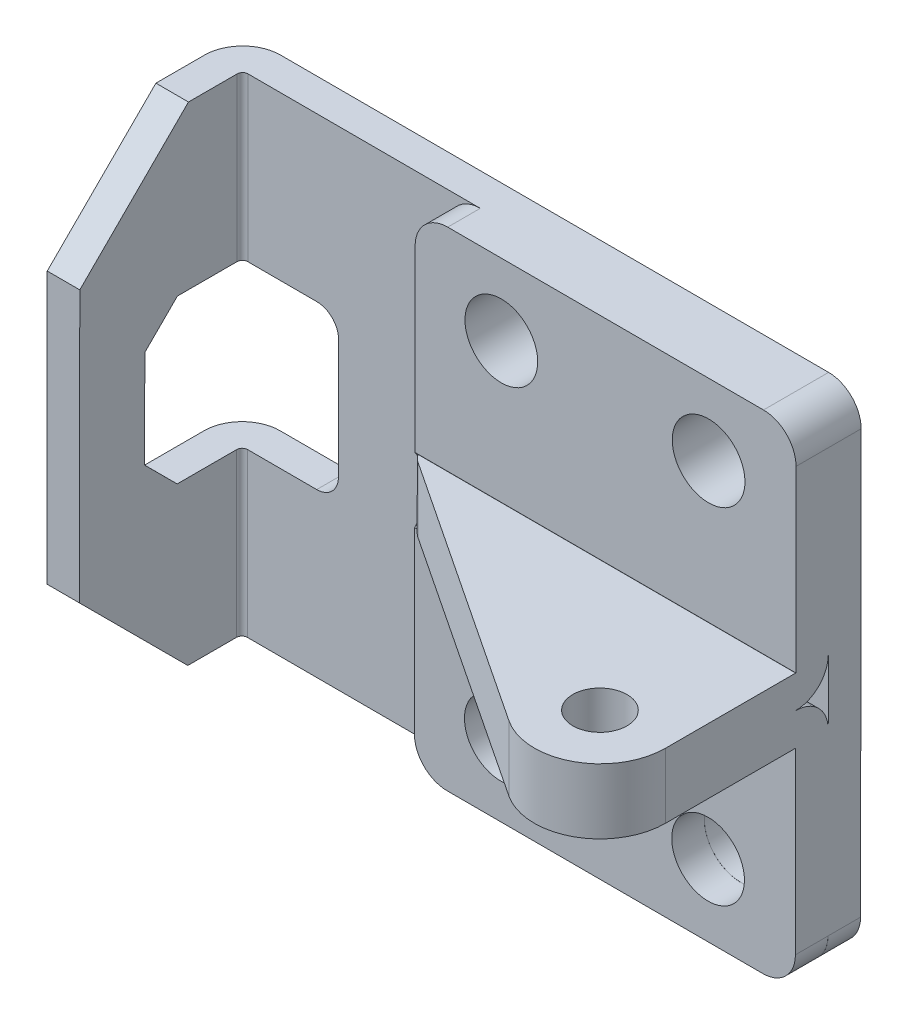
ISO-10303-21;
HEADER;
FILE_DESCRIPTION(('STEP AP214'),'2;1');
FILE_NAME('part.step','',(''),(''),'','','');
FILE_SCHEMA(('AUTOMOTIVE_DESIGN { 1 0 10303 214 1 1 1 1 }'));
ENDSEC;
DATA;
#1=APPLICATION_CONTEXT('core data for automotive mechanical design processes');
#2=APPLICATION_PROTOCOL_DEFINITION('international standard','automotive_design',2000,#1);
#3=PRODUCT_CONTEXT('',#1,'mechanical');
#4=PRODUCT('Part','Part','',(#3));
#5=PRODUCT_RELATED_PRODUCT_CATEGORY('part','',(#4));
#6=PRODUCT_DEFINITION_FORMATION('','',#4);
#7=PRODUCT_DEFINITION_CONTEXT('part definition',#1,'design');
#8=PRODUCT_DEFINITION('design','',#6,#7);
#9=PRODUCT_DEFINITION_SHAPE('','',#8);
#10=(LENGTH_UNIT() NAMED_UNIT(*) SI_UNIT(.MILLI.,.METRE.));
#11=(NAMED_UNIT(*) PLANE_ANGLE_UNIT() SI_UNIT($,.RADIAN.));
#12=(NAMED_UNIT(*) SI_UNIT($,.STERADIAN.) SOLID_ANGLE_UNIT());
#13=UNCERTAINTY_MEASURE_WITH_UNIT(LENGTH_MEASURE(1.E-05),#10,'distance_accuracy_value','');
#14=(GEOMETRIC_REPRESENTATION_CONTEXT(3) GLOBAL_UNCERTAINTY_ASSIGNED_CONTEXT((#13)) GLOBAL_UNIT_ASSIGNED_CONTEXT((#10,
#11,#12)) REPRESENTATION_CONTEXT('',''));
#15=CARTESIAN_POINT('',(0.,0.,0.));
#16=DIRECTION('',(0.,0.,1.));
#17=DIRECTION('',(1.,0.,0.));
#18=AXIS2_PLACEMENT_3D('',#15,#16,#17);
#19=CARTESIAN_POINT('',(-4.73656241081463,45.5634182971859,3.00000000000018));
#20=DIRECTION('',(0.,0.,1.));
#21=DIRECTION('',(0.,-1.,0.));
#22=AXIS2_PLACEMENT_3D('',#19,#20,#21);
#23=PLANE('',#22);
#24=CARTESIAN_POINT('',(-28.9362611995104,10.1973741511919,3.00000000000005));
#25=DIRECTION('',(0.,0.,1.));
#26=DIRECTION('',(0.,-1.,0.));
#27=AXIS2_PLACEMENT_3D('',#24,#25,#26);
#28=CIRCLE('',#27,3.35);
#29=CARTESIAN_POINT('',(-28.9362611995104,6.84737415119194,3.00000000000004));
#30=VERTEX_POINT('',#29);
#31=EDGE_CURVE('E760',#30,#30,#28,.F.);
#32=ORIENTED_EDGE('',*,*,#31,.T.);
#33=EDGE_LOOP('',(#32));
#34=FACE_BOUND('',#33,.T.);
#35=CARTESIAN_POINT('',(-9.83628004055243,10.1705464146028,3.00000000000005));
#36=DIRECTION('',(0.,0.,1.));
#37=DIRECTION('',(0.,-1.,0.));
#38=AXIS2_PLACEMENT_3D('',#35,#36,#37);
#39=CIRCLE('',#38,3.35);
#40=CARTESIAN_POINT('',(-9.83628004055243,6.82054641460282,3.00000000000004));
#41=VERTEX_POINT('',#40);
#42=EDGE_CURVE('E756',#41,#41,#39,.F.);
#43=ORIENTED_EDGE('',*,*,#42,.T.);
#44=EDGE_LOOP('',(#43));
#45=FACE_BOUND('',#44,.T.);
#46=DIRECTION('',(-0.00140459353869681,-0.999999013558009,0.));
#47=VECTOR('',#46,1.);
#48=CARTESIAN_POINT('',(-1.79134451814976,6.55924298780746,3.00000000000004));
#49=LINE('',#48,#47);
#50=CARTESIAN_POINT('',(-1.79134451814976,6.55924298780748,3.00000000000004));
#51=VERTEX_POINT('',#50);
#52=CARTESIAN_POINT('',(-1.75972711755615,29.0692208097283,3.00000000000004));
#53=VERTEX_POINT('',#52);
#54=EDGE_CURVE('E890',#51,#53,#49,.F.);
#55=ORIENTED_EDGE('',*,*,#54,.T.);
#56=DIRECTION('',(0.999999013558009,-0.00140459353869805,0.));
#57=VECTOR('',#56,1.);
#58=CARTESIAN_POINT('',(-36.8596924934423,29.1185220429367,3.00000000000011));
#59=LINE('',#58,#57);
#60=CARTESIAN_POINT('',(-36.8596924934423,29.1185220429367,3.00000000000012));
#61=VERTEX_POINT('',#60);
#62=EDGE_CURVE('E36',#61,#53,#59,.T.);
#63=ORIENTED_EDGE('',*,*,#62,.F.);
#64=DIRECTION('',(0.00140459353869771,0.999999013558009,0.));
#65=VECTOR('',#64,1.);
#66=CARTESIAN_POINT('',(-36.8323169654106,48.6085027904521,3.0000000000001));
#67=LINE('',#66,#65);
#68=CARTESIAN_POINT('',(-36.8365307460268,45.6085057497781,3.00000000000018));
#69=VERTEX_POINT('',#68);
#70=EDGE_CURVE('E31',#61,#69,#67,.T.);
#71=ORIENTED_EDGE('',*,*,#70,.T.);
#72=CARTESIAN_POINT('',(-33.8365337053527,45.604291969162,3.00000000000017));
#73=DIRECTION('',(0.,0.,-1.));
#74=DIRECTION('',(0.,1.,0.));
#75=AXIS2_PLACEMENT_3D('',#72,#73,#74);
#76=CIRCLE('',#75,3.);
#77=CARTESIAN_POINT('',(-33.8323199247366,48.604289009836,3.00000000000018));
#78=VERTEX_POINT('',#77);
#79=EDGE_CURVE('E455',#78,#69,#76,.F.);
#80=ORIENTED_EDGE('',*,*,#79,.F.);
#81=DIRECTION('',(0.999999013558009,-0.00140459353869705,0.));
#82=VECTOR('',#81,1.);
#83=CARTESIAN_POINT('',(-4.73234863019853,48.5634153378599,3.00000000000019));
#84=LINE('',#83,#82);
#85=CARTESIAN_POINT('',(-55.2315024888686,48.6343461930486,3.00000000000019));
#86=VERTEX_POINT('',#85);
#87=EDGE_CURVE('E763',#78,#86,#84,.F.);
#88=ORIENTED_EDGE('',*,*,#87,.T.);
#89=DIRECTION('',(-0.00140459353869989,-0.999999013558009,0.));
#90=VECTOR('',#89,1.);
#91=CARTESIAN_POINT('',(-55.2315024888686,48.6343461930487,3.00000000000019));
#92=LINE('',#91,#90);
#93=CARTESIAN_POINT('',(-55.2525713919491,33.6343609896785,3.00000000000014));
#94=VERTEX_POINT('',#93);
#95=EDGE_CURVE('E699',#86,#94,#92,.T.);
#96=ORIENTED_EDGE('',*,*,#95,.T.);
#97=DIRECTION('',(-0.999999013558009,0.00140459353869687,0.));
#98=VECTOR('',#97,1.);
#99=CARTESIAN_POINT('',(-48.8833740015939,33.6254148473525,3.00000000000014));
#100=LINE('',#99,#98);
#101=CARTESIAN_POINT('',(-48.8833740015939,33.6254148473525,3.00000000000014));
#102=VERTEX_POINT('',#101);
#103=EDGE_CURVE('E930',#94,#102,#100,.F.);
#104=ORIENTED_EDGE('',*,*,#103,.T.);
#105=CARTESIAN_POINT('',(-48.8861831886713,31.6254168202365,3.00000000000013));
#106=DIRECTION('',(0.,0.,1.));
#107=DIRECTION('',(0.,-1.,0.));
#108=AXIS2_PLACEMENT_3D('',#105,#106,#107);
#109=CIRCLE('',#108,2.);
#110=CARTESIAN_POINT('',(-46.8861851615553,31.6226076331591,3.00000000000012));
#111=VERTEX_POINT('',#110);
#112=EDGE_CURVE('E785',#102,#111,#109,.F.);
#113=ORIENTED_EDGE('',*,*,#112,.T.);
#114=DIRECTION('',(0.00140459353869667,0.999999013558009,0.));
#115=VECTOR('',#114,1.);
#116=CARTESIAN_POINT('',(-46.901635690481,20.6226184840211,3.00000000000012));
#117=LINE('',#116,#115);
#118=CARTESIAN_POINT('',(-46.901635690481,20.622618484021,3.0000000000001));
#119=VERTEX_POINT('',#118);
#120=EDGE_CURVE('E688',#111,#119,#117,.F.);
#121=ORIENTED_EDGE('',*,*,#120,.T.);
#122=CARTESIAN_POINT('',(-48.901633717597,20.6254276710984,3.00000000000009));
#123=DIRECTION('',(0.,0.,1.));
#124=DIRECTION('',(0.,-1.,0.));
#125=AXIS2_PLACEMENT_3D('',#122,#123,#124);
#126=CIRCLE('',#125,2.);
#127=CARTESIAN_POINT('',(-48.9044429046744,18.6254296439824,3.00000000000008));
#128=VERTEX_POINT('',#127);
#129=EDGE_CURVE('E780',#119,#128,#126,.F.);
#130=ORIENTED_EDGE('',*,*,#129,.T.);
#131=DIRECTION('',(-0.999999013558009,0.00140459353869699,0.));
#132=VECTOR('',#131,1.);
#133=CARTESIAN_POINT('',(-48.9044429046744,18.6254296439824,3.00000000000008));
#134=LINE('',#133,#132);
#135=CARTESIAN_POINT('',(-55.2736402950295,18.6343757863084,3.00000000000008));
#136=VERTEX_POINT('',#135);
#137=EDGE_CURVE('E783',#136,#128,#134,.F.);
#138=ORIENTED_EDGE('',*,*,#137,.F.);
#139=DIRECTION('',(-0.00140459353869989,-0.999999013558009,0.));
#140=VECTOR('',#139,1.);
#141=CARTESIAN_POINT('',(-55.2736402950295,18.6343757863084,3.00000000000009));
#142=LINE('',#141,#140);
#143=CARTESIAN_POINT('',(-55.29470919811,3.63439058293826,3.));
#144=VERTEX_POINT('',#143);
#145=EDGE_CURVE('E940',#136,#144,#142,.T.);
#146=ORIENTED_EDGE('',*,*,#145,.T.);
#147=DIRECTION('',(-0.999999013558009,0.00140459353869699,0.));
#148=VECTOR('',#147,1.);
#149=CARTESIAN_POINT('',(-4.79555533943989,3.56345972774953,3.));
#150=LINE('',#149,#148);
#151=CARTESIAN_POINT('',(-4.79555533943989,3.56345972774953,3.));
#152=VERTEX_POINT('',#151);
#153=EDGE_CURVE('E772',#144,#152,#150,.F.);
#154=ORIENTED_EDGE('',*,*,#153,.T.);
#155=CARTESIAN_POINT('',(-4.7913415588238,6.56345676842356,3.00000000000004));
#156=DIRECTION('',(0.,0.,-1.));
#157=DIRECTION('',(0.,1.,0.));
#158=AXIS2_PLACEMENT_3D('',#155,#156,#157);
#159=CIRCLE('',#158,3.);
#160=EDGE_CURVE('E769',#51,#152,#159,.T.);
#161=ORIENTED_EDGE('',*,*,#160,.F.);
#162=EDGE_LOOP('',(#55,#63,#71,#80,#88,#96,#104,#113,#121,#130,#138,#146,#154,#161));
#163=FACE_BOUND('',#162,.T.);
#164=ADVANCED_FACE('F14',(#34,#45,#163),#23,.T.);
#165=CARTESIAN_POINT('',(-55.780662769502,13.6350830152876,17.9892036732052));
#166=DIRECTION('',(0.,0.,-1.));
#167=DIRECTION('',(0.,1.,0.));
#168=AXIS2_PLACEMENT_3D('',#165,#166,#167);
#169=PLANE('',#168);
#170=DIRECTION('',(0.00140459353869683,0.999999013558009,0.));
#171=VECTOR('',#170,1.);
#172=CARTESIAN_POINT('',(-55.7357157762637,45.6350514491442,17.9892036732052));
#173=LINE('',#172,#171);
#174=CARTESIAN_POINT('',(-55.7455479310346,38.6350583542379,17.9892036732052));
#175=VERTEX_POINT('',#174);
#176=CARTESIAN_POINT('',(-55.780662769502,13.6350830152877,17.9892036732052));
#177=VERTEX_POINT('',#176);
#178=EDGE_CURVE('E682',#175,#177,#173,.F.);
#179=ORIENTED_EDGE('',*,*,#178,.F.);
#180=DIRECTION('',(-0.999999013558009,0.00140459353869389,0.));
#181=VECTOR('',#180,1.);
#182=CARTESIAN_POINT('',(-55.7455479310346,38.6350583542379,17.9892036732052));
#183=LINE('',#182,#181);
#184=CARTESIAN_POINT('',(-58.7455449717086,38.6392721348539,17.9892036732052));
#185=VERTEX_POINT('',#184);
#186=EDGE_CURVE('E720',#175,#185,#183,.T.);
#187=ORIENTED_EDGE('',*,*,#186,.T.);
#188=DIRECTION('',(0.00140459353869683,0.999999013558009,0.));
#189=VECTOR('',#188,1.);
#190=CARTESIAN_POINT('',(-58.7357128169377,45.6392652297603,17.9892036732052));
#191=LINE('',#190,#189);
#192=CARTESIAN_POINT('',(-58.780659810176,13.6392967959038,17.9892036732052));
#193=VERTEX_POINT('',#192);
#194=EDGE_CURVE('E713',#185,#193,#191,.F.);
#195=ORIENTED_EDGE('',*,*,#194,.T.);
#196=DIRECTION('',(0.999999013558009,-0.00140459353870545,0.));
#197=VECTOR('',#196,1.);
#198=CARTESIAN_POINT('',(-58.780659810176,13.6392967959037,17.9892036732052));
#199=LINE('',#198,#197);
#200=EDGE_CURVE('E679',#193,#177,#199,.T.);
#201=ORIENTED_EDGE('',*,*,#200,.T.);
#202=EDGE_LOOP('',(#179,#187,#195,#201));
#203=FACE_BOUND('',#202,.T.);
#204=ADVANCED_FACE('F16',(#203),#169,.F.);
#205=CARTESIAN_POINT('',(-83.7693984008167,21.6744037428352,11.9892036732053));
#206=DIRECTION('',(0.,0.,-1.));
#207=DIRECTION('',(0.,1.,0.));
#208=AXIS2_PLACEMENT_3D('',#205,#206,#207);
#209=PLANE('',#208);
#210=DIRECTION('',(-0.999999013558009,0.00140459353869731,0.));
#211=VECTOR('',#210,1.);
#212=CARTESIAN_POINT('',(-55.7567846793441,30.6350662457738,11.9892036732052));
#213=LINE('',#212,#211);
#214=CARTESIAN_POINT('',(-55.7567846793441,30.6350662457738,11.9892036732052));
#215=VERTEX_POINT('',#214);
#216=CARTESIAN_POINT('',(-58.7567817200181,30.63928002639,11.9892036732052));
#217=VERTEX_POINT('',#216);
#218=EDGE_CURVE('E656',#215,#217,#213,.T.);
#219=ORIENTED_EDGE('',*,*,#218,.F.);
#220=DIRECTION('',(0.00140459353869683,0.999999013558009,0.));
#221=VECTOR('',#220,1.);
#222=CARTESIAN_POINT('',(-55.7357157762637,45.6350514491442,11.9892036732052));
#223=LINE('',#222,#221);
#224=CARTESIAN_POINT('',(-55.7694260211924,21.6350751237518,11.9892036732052));
#225=VERTEX_POINT('',#224);
#226=EDGE_CURVE('E658',#225,#215,#223,.T.);
#227=ORIENTED_EDGE('',*,*,#226,.F.);
#228=DIRECTION('',(0.999999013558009,-0.00140459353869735,0.));
#229=VECTOR('',#228,1.);
#230=CARTESIAN_POINT('',(-58.7694230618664,21.6392889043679,11.9892036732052));
#231=LINE('',#230,#229);
#232=CARTESIAN_POINT('',(-58.7694230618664,21.6392889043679,11.9892036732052));
#233=VERTEX_POINT('',#232);
#234=EDGE_CURVE('E663',#233,#225,#231,.T.);
#235=ORIENTED_EDGE('',*,*,#234,.F.);
#236=DIRECTION('',(0.00140459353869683,0.999999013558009,0.));
#237=VECTOR('',#236,1.);
#238=CARTESIAN_POINT('',(-58.7357128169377,45.6392652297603,11.9892036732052));
#239=LINE('',#238,#237);
#240=EDGE_CURVE('E660',#233,#217,#239,.T.);
#241=ORIENTED_EDGE('',*,*,#240,.T.);
#242=EDGE_LOOP('',(#219,#227,#235,#241));
#243=FACE_BOUND('',#242,.T.);
#244=ADVANCED_FACE('F644',(#243),#209,.T.);
#245=CARTESIAN_POINT('',(-55.2201023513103,56.7506631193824,3.50000000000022));
#246=DIRECTION('',(-0.00140459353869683,-0.999999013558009,0.));
#247=DIRECTION('',(0.999999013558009,-0.00140459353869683,0.));
#248=AXIS2_PLACEMENT_3D('',#245,#246,#247);
#249=CYLINDRICAL_SURFACE('',#248,0.5);
#250=ORIENTED_EDGE('',*,*,#95,.F.);
#251=CARTESIAN_POINT('',(-55.2315024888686,48.6343461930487,3.50000000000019));
#252=DIRECTION('',(-0.00140459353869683,-0.999999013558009,0.));
#253=DIRECTION('',(0.999999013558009,-0.00140459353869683,0.));
#254=AXIS2_PLACEMENT_3D('',#251,#252,#253);
#255=CIRCLE('',#254,0.5);
#256=CARTESIAN_POINT('',(-55.7315019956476,48.635048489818,3.50000000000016));
#257=VERTEX_POINT('',#256);
#258=EDGE_CURVE('E18',#257,#86,#255,.T.);
#259=ORIENTED_EDGE('',*,*,#258,.F.);
#260=DIRECTION('',(0.00140459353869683,0.999999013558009,0.));
#261=VECTOR('',#260,1.);
#262=CARTESIAN_POINT('',(-55.7357157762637,45.6350514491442,3.50000000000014));
#263=LINE('',#262,#261);
#264=CARTESIAN_POINT('',(-55.7525708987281,33.6350632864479,3.50000000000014));
#265=VERTEX_POINT('',#264);
#266=EDGE_CURVE('E678',#265,#257,#263,.T.);
#267=ORIENTED_EDGE('',*,*,#266,.F.);
#268=CARTESIAN_POINT('',(-55.2525713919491,33.6343609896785,3.50000000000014));
#269=DIRECTION('',(-0.00140459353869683,-0.999999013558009,0.));
#270=DIRECTION('',(0.999999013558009,-0.00140459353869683,0.));
#271=AXIS2_PLACEMENT_3D('',#268,#269,#270);
#272=CIRCLE('',#271,0.5);
#273=EDGE_CURVE('E795',#94,#265,#272,.F.);
#274=ORIENTED_EDGE('',*,*,#273,.F.);
#275=EDGE_LOOP('',(#250,#259,#267,#274));
#276=FACE_BOUND('',#275,.T.);
#277=ADVANCED_FACE('F641',(#276),#249,.F.);
#278=CARTESIAN_POINT('',(-55.2622401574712,26.7506927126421,3.50000000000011));
#279=DIRECTION('',(-0.00140459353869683,-0.999999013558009,0.));
#280=DIRECTION('',(0.999999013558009,-0.00140459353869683,0.));
#281=AXIS2_PLACEMENT_3D('',#278,#279,#280);
#282=CYLINDRICAL_SURFACE('',#281,0.5);
#283=ORIENTED_EDGE('',*,*,#145,.F.);
#284=CARTESIAN_POINT('',(-55.2736402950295,18.6343757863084,3.50000000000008));
#285=DIRECTION('',(-0.00140459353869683,-0.999999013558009,0.));
#286=DIRECTION('',(0.999999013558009,-0.00140459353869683,0.));
#287=AXIS2_PLACEMENT_3D('',#284,#285,#286);
#288=CIRCLE('',#287,0.5);
#289=CARTESIAN_POINT('',(-55.7736398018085,18.6350780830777,3.5));
#290=VERTEX_POINT('',#289);
#291=EDGE_CURVE('E794',#290,#136,#288,.T.);
#292=ORIENTED_EDGE('',*,*,#291,.F.);
#293=DIRECTION('',(0.00140459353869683,0.999999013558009,0.));
#294=VECTOR('',#293,1.);
#295=CARTESIAN_POINT('',(-55.7357157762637,45.6350514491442,3.5));
#296=LINE('',#295,#294);
#297=CARTESIAN_POINT('',(-55.794708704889,3.6350928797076,3.5));
#298=VERTEX_POINT('',#297);
#299=EDGE_CURVE('E957',#298,#290,#296,.T.);
#300=ORIENTED_EDGE('',*,*,#299,.F.);
#301=CARTESIAN_POINT('',(-55.29470919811,3.63439058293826,3.5));
#302=DIRECTION('',(-0.00140459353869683,-0.999999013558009,0.));
#303=DIRECTION('',(0.999999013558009,-0.00140459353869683,0.));
#304=AXIS2_PLACEMENT_3D('',#301,#302,#303);
#305=CIRCLE('',#304,0.5);
#306=EDGE_CURVE('E664',#144,#298,#305,.F.);
#307=ORIENTED_EDGE('',*,*,#306,.F.);
#308=EDGE_LOOP('',(#283,#292,#300,#307));
#309=FACE_BOUND('',#308,.T.);
#310=ADVANCED_FACE('F637',(#309),#282,.F.);
#311=CARTESIAN_POINT('',(-83.7567570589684,30.6743948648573,11.9892036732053));
#312=DIRECTION('',(-0.000993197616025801,-0.707106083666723,-0.707106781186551));
#313=DIRECTION('',(0.,0.707107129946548,-0.707106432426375));
#314=AXIS2_PLACEMENT_3D('',#311,#312,#313);
#315=PLANE('',#314);
#316=DIRECTION('',(-0.999999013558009,0.00140459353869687,0.));
#317=VECTOR('',#316,1.);
#318=CARTESIAN_POINT('',(-48.8833740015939,33.6254148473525,8.98920367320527));
#319=LINE('',#318,#317);
#320=CARTESIAN_POINT('',(-58.7525679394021,33.639277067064,8.98920367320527));
#321=VERTEX_POINT('',#320);
#322=CARTESIAN_POINT('',(-55.7525708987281,33.6350632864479,8.98920367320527));
#323=VERTEX_POINT('',#322);
#324=EDGE_CURVE('E677',#321,#323,#319,.F.);
#325=ORIENTED_EDGE('',*,*,#324,.T.);
#326=DIRECTION('',(0.000993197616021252,0.707106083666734,-0.70710678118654));
#327=VECTOR('',#326,1.);
#328=CARTESIAN_POINT('',(-55.7567846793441,30.6350662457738,11.9892036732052));
#329=LINE('',#328,#327);
#330=EDGE_CURVE('E668',#215,#323,#329,.T.);
#331=ORIENTED_EDGE('',*,*,#330,.F.);
#332=ORIENTED_EDGE('',*,*,#218,.T.);
#333=DIRECTION('',(0.000993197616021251,0.707106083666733,-0.707106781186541));
#334=VECTOR('',#333,1.);
#335=CARTESIAN_POINT('',(-58.7567817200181,30.6392800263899,11.9892036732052));
#336=LINE('',#335,#334);
#337=EDGE_CURVE('E697',#217,#321,#336,.T.);
#338=ORIENTED_EDGE('',*,*,#337,.T.);
#339=EDGE_LOOP('',(#325,#331,#332,#338));
#340=FACE_BOUND('',#339,.T.);
#341=ADVANCED_FACE('F633',(#340),#315,.T.);
#342=CARTESIAN_POINT('',(-83.7736121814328,18.6744067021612,8.98920367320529));
#343=DIRECTION('',(0.000993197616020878,0.707106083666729,-0.707106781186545));
#344=DIRECTION('',(0.,0.707107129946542,0.707106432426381));
#345=AXIS2_PLACEMENT_3D('',#342,#343,#344);
#346=PLANE('',#345);
#347=ORIENTED_EDGE('',*,*,#234,.T.);
#348=DIRECTION('',(0.000993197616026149,0.707106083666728,0.707106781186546));
#349=VECTOR('',#348,1.);
#350=CARTESIAN_POINT('',(-55.7736398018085,18.6350780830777,8.98920367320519));
#351=LINE('',#350,#349);
#352=CARTESIAN_POINT('',(-55.7736398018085,18.6350780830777,8.98920367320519));
#353=VERTEX_POINT('',#352);
#354=EDGE_CURVE('E672',#353,#225,#351,.T.);
#355=ORIENTED_EDGE('',*,*,#354,.F.);
#356=DIRECTION('',(-0.999999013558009,0.00140459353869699,0.));
#357=VECTOR('',#356,1.);
#358=CARTESIAN_POINT('',(-48.9044429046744,18.6254296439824,8.98920367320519));
#359=LINE('',#358,#357);
#360=CARTESIAN_POINT('',(-58.7736368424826,18.6392918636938,8.98920367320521));
#361=VERTEX_POINT('',#360);
#362=EDGE_CURVE('E913',#361,#353,#359,.F.);
#363=ORIENTED_EDGE('',*,*,#362,.F.);
#364=DIRECTION('',(0.000993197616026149,0.707106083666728,0.707106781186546));
#365=VECTOR('',#364,1.);
#366=CARTESIAN_POINT('',(-58.7736368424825,18.6392918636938,8.98920367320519));
#367=LINE('',#366,#365);
#368=EDGE_CURVE('E705',#361,#233,#367,.T.);
#369=ORIENTED_EDGE('',*,*,#368,.T.);
#370=EDGE_LOOP('',(#347,#355,#363,#369));
#371=FACE_BOUND('',#370,.T.);
#372=ADVANCED_FACE('F629',(#371),#346,.T.);
#373=CARTESIAN_POINT('',(-55.794708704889,3.63509287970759,7.98920367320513));
#374=DIRECTION('',(0.000993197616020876,0.707106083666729,-0.707106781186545));
#375=DIRECTION('',(0.,0.707107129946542,0.707106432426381));
#376=AXIS2_PLACEMENT_3D('',#373,#374,#375);
#377=PLANE('',#376);
#378=DIRECTION('',(-0.000993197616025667,-0.707106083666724,-0.70710678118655));
#379=VECTOR('',#378,1.);
#380=CARTESIAN_POINT('',(-55.780662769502,13.6350830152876,17.9892036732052));
#381=LINE('',#380,#379);
#382=CARTESIAN_POINT('',(-55.794708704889,3.63509287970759,7.98920367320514));
#383=VERTEX_POINT('',#382);
#384=EDGE_CURVE('E725',#177,#383,#381,.T.);
#385=ORIENTED_EDGE('',*,*,#384,.F.);
#386=ORIENTED_EDGE('',*,*,#200,.F.);
#387=DIRECTION('',(-0.000993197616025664,-0.707106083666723,-0.707106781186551));
#388=VECTOR('',#387,1.);
#389=CARTESIAN_POINT('',(-58.780659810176,13.6392967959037,17.9892036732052));
#390=LINE('',#389,#388);
#391=CARTESIAN_POINT('',(-58.794705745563,3.63930666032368,7.98920367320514));
#392=VERTEX_POINT('',#391);
#393=EDGE_CURVE('E716',#193,#392,#390,.T.);
#394=ORIENTED_EDGE('',*,*,#393,.T.);
#395=DIRECTION('',(-0.999999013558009,0.00140459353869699,0.));
#396=VECTOR('',#395,1.);
#397=CARTESIAN_POINT('',(-4.79555533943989,3.56345972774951,7.98920367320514));
#398=LINE('',#397,#396);
#399=EDGE_CURVE('E900',#392,#383,#398,.F.);
#400=ORIENTED_EDGE('',*,*,#399,.T.);
#401=EDGE_LOOP('',(#385,#386,#394,#400));
#402=FACE_BOUND('',#401,.T.);
#403=ADVANCED_FACE('F625',(#402),#377,.F.);
#404=CARTESIAN_POINT('',(-55.7357157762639,45.6350514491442,-50.1407963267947));
#405=DIRECTION('',(0.999999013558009,-0.00140459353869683,0.));
#406=DIRECTION('',(0.00140459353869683,0.999999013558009,0.));
#407=AXIS2_PLACEMENT_3D('',#404,#405,#406);
#408=PLANE('',#407);
#409=ORIENTED_EDGE('',*,*,#354,.T.);
#410=ORIENTED_EDGE('',*,*,#226,.T.);
#411=ORIENTED_EDGE('',*,*,#330,.T.);
#412=DIRECTION('',(0.,0.,1.));
#413=VECTOR('',#412,1.);
#414=CARTESIAN_POINT('',(-55.7525708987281,33.635063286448,-25.));
#415=LINE('',#414,#413);
#416=EDGE_CURVE('E693',#323,#265,#415,.F.);
#417=ORIENTED_EDGE('',*,*,#416,.T.);
#418=ORIENTED_EDGE('',*,*,#266,.T.);
#419=DIRECTION('',(0.,0.,1.));
#420=VECTOR('',#419,1.);
#421=CARTESIAN_POINT('',(-55.7315019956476,48.635048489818,3.00000000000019));
#422=LINE('',#421,#420);
#423=CARTESIAN_POINT('',(-55.7315019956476,48.635048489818,7.9892036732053));
#424=VERTEX_POINT('',#423);
#425=EDGE_CURVE('E881',#257,#424,#422,.T.);
#426=ORIENTED_EDGE('',*,*,#425,.T.);
#427=DIRECTION('',(-0.000993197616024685,-0.707106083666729,0.707106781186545));
#428=VECTOR('',#427,1.);
#429=CARTESIAN_POINT('',(-55.7315019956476,48.635048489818,7.98920367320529));
#430=LINE('',#429,#428);
#431=EDGE_CURVE('E673',#424,#175,#430,.T.);
#432=ORIENTED_EDGE('',*,*,#431,.T.);
#433=ORIENTED_EDGE('',*,*,#178,.T.);
#434=ORIENTED_EDGE('',*,*,#384,.T.);
#435=DIRECTION('',(0.,0.,1.));
#436=VECTOR('',#435,1.);
#437=CARTESIAN_POINT('',(-55.794708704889,3.6350928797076,3.));
#438=LINE('',#437,#436);
#439=EDGE_CURVE('E897',#383,#298,#438,.F.);
#440=ORIENTED_EDGE('',*,*,#439,.T.);
#441=ORIENTED_EDGE('',*,*,#299,.T.);
#442=DIRECTION('',(0.,0.,1.));
#443=VECTOR('',#442,1.);
#444=CARTESIAN_POINT('',(-55.7736398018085,18.6350780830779,-25.));
#445=LINE('',#444,#443);
#446=EDGE_CURVE('E910',#353,#290,#445,.F.);
#447=ORIENTED_EDGE('',*,*,#446,.F.);
#448=EDGE_LOOP('',(#409,#410,#411,#417,#418,#426,#432,#433,#434,#440,#441,#447));
#449=FACE_BOUND('',#448,.T.);
#450=ADVANCED_FACE('F621',(#449),#408,.T.);
#451=CARTESIAN_POINT('',(-55.7315019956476,48.635048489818,7.98920367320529));
#452=DIRECTION('',(-0.000993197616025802,-0.707106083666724,-0.70710678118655));
#453=DIRECTION('',(0.,0.707107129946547,-0.707106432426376));
#454=AXIS2_PLACEMENT_3D('',#451,#452,#453);
#455=PLANE('',#454);
#456=ORIENTED_EDGE('',*,*,#431,.F.);
#457=DIRECTION('',(0.999999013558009,-0.00140459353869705,0.));
#458=VECTOR('',#457,1.);
#459=CARTESIAN_POINT('',(-4.73234863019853,48.5634153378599,7.98920367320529));
#460=LINE('',#459,#458);
#461=CARTESIAN_POINT('',(-58.7314990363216,48.6392622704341,7.9892036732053));
#462=VERTEX_POINT('',#461);
#463=EDGE_CURVE('E878',#424,#462,#460,.F.);
#464=ORIENTED_EDGE('',*,*,#463,.T.);
#465=DIRECTION('',(-0.000993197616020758,-0.70710608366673,0.707106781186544));
#466=VECTOR('',#465,1.);
#467=CARTESIAN_POINT('',(-58.7314990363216,48.6392622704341,7.9892036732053));
#468=LINE('',#467,#466);
#469=EDGE_CURVE('E717',#462,#185,#468,.T.);
#470=ORIENTED_EDGE('',*,*,#469,.T.);
#471=ORIENTED_EDGE('',*,*,#186,.F.);
#472=EDGE_LOOP('',(#456,#464,#470,#471));
#473=FACE_BOUND('',#472,.T.);
#474=ADVANCED_FACE('F617',(#473),#455,.F.);
#475=CARTESIAN_POINT('',(-58.7357128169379,45.6392652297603,-50.1407963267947));
#476=DIRECTION('',(0.999999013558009,-0.00140459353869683,0.));
#477=DIRECTION('',(0.00140459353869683,0.999999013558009,0.));
#478=AXIS2_PLACEMENT_3D('',#475,#476,#477);
#479=PLANE('',#478);
#480=DIRECTION('',(0.,0.,1.));
#481=VECTOR('',#480,1.);
#482=CARTESIAN_POINT('',(-58.7525679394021,33.6392770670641,-25.));
#483=LINE('',#482,#481);
#484=CARTESIAN_POINT('',(-58.7525679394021,33.639277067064,3.50000000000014));
#485=VERTEX_POINT('',#484);
#486=EDGE_CURVE('E694',#485,#321,#483,.T.);
#487=ORIENTED_EDGE('',*,*,#486,.T.);
#488=ORIENTED_EDGE('',*,*,#337,.F.);
#489=ORIENTED_EDGE('',*,*,#240,.F.);
#490=ORIENTED_EDGE('',*,*,#368,.F.);
#491=DIRECTION('',(0.,0.,1.));
#492=VECTOR('',#491,1.);
#493=CARTESIAN_POINT('',(-58.7736368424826,18.6392918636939,-25.));
#494=LINE('',#493,#492);
#495=CARTESIAN_POINT('',(-58.7736368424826,18.6392918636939,3.50000000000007));
#496=VERTEX_POINT('',#495);
#497=EDGE_CURVE('E916',#496,#361,#494,.T.);
#498=ORIENTED_EDGE('',*,*,#497,.F.);
#499=DIRECTION('',(-0.00140459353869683,-0.999999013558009,0.));
#500=VECTOR('',#499,1.);
#501=CARTESIAN_POINT('',(-58.7622367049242,26.7556087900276,3.50000000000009));
#502=LINE('',#501,#500);
#503=CARTESIAN_POINT('',(-58.794705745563,3.6393066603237,3.5));
#504=VERTEX_POINT('',#503);
#505=EDGE_CURVE('E779',#504,#496,#502,.F.);
#506=ORIENTED_EDGE('',*,*,#505,.F.);
#507=DIRECTION('',(0.,0.,1.));
#508=VECTOR('',#507,1.);
#509=CARTESIAN_POINT('',(-58.794705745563,3.6393066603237,3.));
#510=LINE('',#509,#508);
#511=EDGE_CURVE('E776',#504,#392,#510,.T.);
#512=ORIENTED_EDGE('',*,*,#511,.T.);
#513=ORIENTED_EDGE('',*,*,#393,.F.);
#514=ORIENTED_EDGE('',*,*,#194,.F.);
#515=ORIENTED_EDGE('',*,*,#469,.F.);
#516=DIRECTION('',(0.,0.,1.));
#517=VECTOR('',#516,1.);
#518=CARTESIAN_POINT('',(-58.7314990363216,48.6392622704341,3.00000000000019));
#519=LINE('',#518,#517);
#520=CARTESIAN_POINT('',(-58.7314990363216,48.6392622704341,3.5000000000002));
#521=VERTEX_POINT('',#520);
#522=EDGE_CURVE('E768',#462,#521,#519,.F.);
#523=ORIENTED_EDGE('',*,*,#522,.T.);
#524=DIRECTION('',(-0.00140459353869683,-0.999999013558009,0.));
#525=VECTOR('',#524,1.);
#526=CARTESIAN_POINT('',(-58.7200988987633,56.7555791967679,3.50000000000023));
#527=LINE('',#526,#525);
#528=EDGE_CURVE('E792',#485,#521,#527,.F.);
#529=ORIENTED_EDGE('',*,*,#528,.F.);
#530=EDGE_LOOP('',(#487,#488,#489,#490,#498,#506,#512,#513,#514,#515,#523,#529));
#531=FACE_BOUND('',#530,.T.);
#532=ADVANCED_FACE('F610',(#531),#479,.F.);
#533=CARTESIAN_POINT('',(-55.2201023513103,56.7506631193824,3.50000000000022));
#534=DIRECTION('',(-0.00140459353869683,-0.999999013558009,0.));
#535=DIRECTION('',(0.999999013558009,-0.00140459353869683,0.));
#536=AXIS2_PLACEMENT_3D('',#533,#534,#535);
#537=CYLINDRICAL_SURFACE('',#536,3.5);
#538=ORIENTED_EDGE('',*,*,#528,.T.);
#539=CARTESIAN_POINT('',(-55.2315024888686,48.6343461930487,3.50000000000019));
#540=DIRECTION('',(-0.00140459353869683,-0.999999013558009,0.));
#541=DIRECTION('',(0.999999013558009,-0.00140459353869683,0.));
#542=AXIS2_PLACEMENT_3D('',#539,#540,#541);
#543=CIRCLE('',#542,3.5);
#544=CARTESIAN_POINT('',(-55.2315024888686,48.6343461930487,1.88096174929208E-13));
#545=VERTEX_POINT('',#544);
#546=EDGE_CURVE('E764',#521,#545,#543,.T.);
#547=ORIENTED_EDGE('',*,*,#546,.T.);
#548=DIRECTION('',(-0.00140459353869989,-0.999999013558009,0.));
#549=VECTOR('',#548,1.);
#550=CARTESIAN_POINT('',(-55.2315024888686,48.6343461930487,1.87974852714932E-13));
#551=LINE('',#550,#549);
#552=CARTESIAN_POINT('',(-55.2525713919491,33.6343609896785,1.34044619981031E-13));
#553=VERTEX_POINT('',#552);
#554=EDGE_CURVE('E759',#545,#553,#551,.T.);
#555=ORIENTED_EDGE('',*,*,#554,.T.);
#556=CARTESIAN_POINT('',(-55.2525713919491,33.6343609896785,3.50000000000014));
#557=DIRECTION('',(-0.00140459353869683,-0.999999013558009,0.));
#558=DIRECTION('',(0.999999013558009,-0.00140459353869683,0.));
#559=AXIS2_PLACEMENT_3D('',#556,#557,#558);
#560=CIRCLE('',#559,3.5);
#561=EDGE_CURVE('E789',#553,#485,#560,.F.);
#562=ORIENTED_EDGE('',*,*,#561,.T.);
#563=EDGE_LOOP('',(#538,#547,#555,#562));
#564=FACE_BOUND('',#563,.T.);
#565=ADVANCED_FACE('F606',(#564),#537,.T.);
#566=CARTESIAN_POINT('',(-48.8833740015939,33.6254148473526,-25.));
#567=DIRECTION('',(0.00140459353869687,0.999999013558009,0.));
#568=DIRECTION('',(-0.999999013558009,0.00140459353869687,0.));
#569=AXIS2_PLACEMENT_3D('',#566,#567,#568);
#570=PLANE('',#569);
#571=DIRECTION('',(0.,0.,1.));
#572=VECTOR('',#571,1.);
#573=CARTESIAN_POINT('',(-48.8833740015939,33.6254148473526,-25.));
#574=LINE('',#573,#572);
#575=CARTESIAN_POINT('',(-48.8833740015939,33.6254148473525,1.35374026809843E-13));
#576=VERTEX_POINT('',#575);
#577=EDGE_CURVE('E788',#576,#102,#574,.T.);
#578=ORIENTED_EDGE('',*,*,#577,.T.);
#579=ORIENTED_EDGE('',*,*,#103,.F.);
#580=ORIENTED_EDGE('',*,*,#273,.T.);
#581=ORIENTED_EDGE('',*,*,#416,.F.);
#582=ORIENTED_EDGE('',*,*,#324,.F.);
#583=ORIENTED_EDGE('',*,*,#486,.F.);
#584=ORIENTED_EDGE('',*,*,#561,.F.);
#585=DIRECTION('',(0.999999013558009,-0.0014045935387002,0.));
#586=VECTOR('',#585,1.);
#587=CARTESIAN_POINT('',(-55.2525713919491,33.6343609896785,1.34949213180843E-13));
#588=LINE('',#587,#586);
#589=EDGE_CURVE('E755',#553,#576,#588,.T.);
#590=ORIENTED_EDGE('',*,*,#589,.T.);
#591=EDGE_LOOP('',(#578,#579,#580,#581,#582,#583,#584,#590));
#592=FACE_BOUND('',#591,.T.);
#593=ADVANCED_FACE('F602',(#592),#570,.F.);
#594=CARTESIAN_POINT('',(-48.8861831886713,31.6254168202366,-25.));
#595=DIRECTION('',(0.,0.,1.));
#596=DIRECTION('',(0.,-1.,0.));
#597=AXIS2_PLACEMENT_3D('',#594,#595,#596);
#598=CYLINDRICAL_SURFACE('',#597,2.);
#599=ORIENTED_EDGE('',*,*,#112,.F.);
#600=ORIENTED_EDGE('',*,*,#577,.F.);
#601=CARTESIAN_POINT('',(-48.8861831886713,31.6254168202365,1.28369537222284E-13));
#602=DIRECTION('',(0.,0.,1.));
#603=DIRECTION('',(0.,-1.,0.));
#604=AXIS2_PLACEMENT_3D('',#601,#602,#603);
#605=CIRCLE('',#604,2.);
#606=CARTESIAN_POINT('',(-46.8861851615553,31.6226076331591,1.28373471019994E-13));
#607=VERTEX_POINT('',#606);
#608=EDGE_CURVE('E752',#576,#607,#605,.F.);
#609=ORIENTED_EDGE('',*,*,#608,.T.);
#610=DIRECTION('',(0.,0.,1.));
#611=VECTOR('',#610,1.);
#612=CARTESIAN_POINT('',(-46.8861851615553,31.6226076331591,-25.));
#613=LINE('',#612,#611);
#614=EDGE_CURVE('E787',#607,#111,#613,.T.);
#615=ORIENTED_EDGE('',*,*,#614,.T.);
#616=EDGE_LOOP('',(#599,#600,#609,#615));
#617=FACE_BOUND('',#616,.T.);
#618=ADVANCED_FACE('F598',(#617),#598,.F.);
#619=CARTESIAN_POINT('',(-46.901635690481,20.6226184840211,-25.));
#620=DIRECTION('',(0.999999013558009,-0.00140459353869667,0.));
#621=DIRECTION('',(0.00140459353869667,0.999999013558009,0.));
#622=AXIS2_PLACEMENT_3D('',#619,#620,#621);
#623=PLANE('',#622);
#624=ORIENTED_EDGE('',*,*,#120,.F.);
#625=ORIENTED_EDGE('',*,*,#614,.F.);
#626=DIRECTION('',(-0.00140459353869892,-0.999999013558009,0.));
#627=VECTOR('',#626,1.);
#628=CARTESIAN_POINT('',(-46.8861851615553,31.6226076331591,1.27912050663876E-13));
#629=LINE('',#628,#627);
#630=CARTESIAN_POINT('',(-46.901635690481,20.622618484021,0.));
#631=VERTEX_POINT('',#630);
#632=EDGE_CURVE('E751',#607,#631,#629,.T.);
#633=ORIENTED_EDGE('',*,*,#632,.T.);
#634=DIRECTION('',(0.,0.,1.));
#635=VECTOR('',#634,1.);
#636=CARTESIAN_POINT('',(-46.901635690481,20.6226184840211,-25.));
#637=LINE('',#636,#635);
#638=EDGE_CURVE('E784',#631,#119,#637,.T.);
#639=ORIENTED_EDGE('',*,*,#638,.T.);
#640=EDGE_LOOP('',(#624,#625,#633,#639));
#641=FACE_BOUND('',#640,.T.);
#642=ADVANCED_FACE('F594',(#641),#623,.F.);
#643=CARTESIAN_POINT('',(-48.901633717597,20.6254276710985,-25.));
#644=DIRECTION('',(0.,0.,1.));
#645=DIRECTION('',(0.,-1.,0.));
#646=AXIS2_PLACEMENT_3D('',#643,#644,#645);
#647=CYLINDRICAL_SURFACE('',#646,2.);
#648=ORIENTED_EDGE('',*,*,#129,.F.);
#649=ORIENTED_EDGE('',*,*,#638,.F.);
#650=CARTESIAN_POINT('',(-48.901633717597,20.6254276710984,0.));
#651=DIRECTION('',(0.,0.,1.));
#652=DIRECTION('',(0.,-1.,0.));
#653=AXIS2_PLACEMENT_3D('',#650,#651,#652);
#654=CIRCLE('',#653,2.);
#655=CARTESIAN_POINT('',(-48.9044429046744,18.6254296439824,0.));
#656=VERTEX_POINT('',#655);
#657=EDGE_CURVE('E747',#631,#656,#654,.F.);
#658=ORIENTED_EDGE('',*,*,#657,.T.);
#659=DIRECTION('',(0.,0.,1.));
#660=VECTOR('',#659,1.);
#661=CARTESIAN_POINT('',(-48.9044429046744,18.6254296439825,-25.));
#662=LINE('',#661,#660);
#663=EDGE_CURVE('E919',#128,#656,#662,.F.);
#664=ORIENTED_EDGE('',*,*,#663,.F.);
#665=EDGE_LOOP('',(#648,#649,#658,#664));
#666=FACE_BOUND('',#665,.T.);
#667=ADVANCED_FACE('F590',(#666),#647,.F.);
#668=CARTESIAN_POINT('',(-48.9044429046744,18.6254296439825,-25.));
#669=DIRECTION('',(0.00140459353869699,0.999999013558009,0.));
#670=DIRECTION('',(-0.999999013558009,0.00140459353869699,0.));
#671=AXIS2_PLACEMENT_3D('',#668,#669,#670);
#672=PLANE('',#671);
#673=ORIENTED_EDGE('',*,*,#446,.T.);
#674=ORIENTED_EDGE('',*,*,#291,.T.);
#675=ORIENTED_EDGE('',*,*,#137,.T.);
#676=ORIENTED_EDGE('',*,*,#663,.T.);
#677=DIRECTION('',(-0.999999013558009,0.00140459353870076,0.));
#678=VECTOR('',#677,1.);
#679=CARTESIAN_POINT('',(-48.9044429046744,18.6254296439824,0.));
#680=LINE('',#679,#678);
#681=CARTESIAN_POINT('',(-55.2736402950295,18.6343757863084,0.));
#682=VERTEX_POINT('',#681);
#683=EDGE_CURVE('E750',#656,#682,#680,.T.);
#684=ORIENTED_EDGE('',*,*,#683,.T.);
#685=CARTESIAN_POINT('',(-55.2736402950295,18.6343757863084,3.50000000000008));
#686=DIRECTION('',(-0.00140459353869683,-0.999999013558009,0.));
#687=DIRECTION('',(0.999999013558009,-0.00140459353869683,0.));
#688=AXIS2_PLACEMENT_3D('',#685,#686,#687);
#689=CIRCLE('',#688,3.5);
#690=EDGE_CURVE('E777',#496,#682,#689,.T.);
#691=ORIENTED_EDGE('',*,*,#690,.F.);
#692=ORIENTED_EDGE('',*,*,#497,.T.);
#693=ORIENTED_EDGE('',*,*,#362,.T.);
#694=EDGE_LOOP('',(#673,#674,#675,#676,#684,#691,#692,#693));
#695=FACE_BOUND('',#694,.T.);
#696=ADVANCED_FACE('F586',(#695),#672,.T.);
#697=CARTESIAN_POINT('',(-55.2622401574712,26.7506927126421,3.50000000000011));
#698=DIRECTION('',(-0.00140459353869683,-0.999999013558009,0.));
#699=DIRECTION('',(0.999999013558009,-0.00140459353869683,0.));
#700=AXIS2_PLACEMENT_3D('',#697,#698,#699);
#701=CYLINDRICAL_SURFACE('',#700,3.5);
#702=ORIENTED_EDGE('',*,*,#505,.T.);
#703=ORIENTED_EDGE('',*,*,#690,.T.);
#704=DIRECTION('',(-0.00140459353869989,-0.999999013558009,0.));
#705=VECTOR('',#704,1.);
#706=CARTESIAN_POINT('',(-55.2736402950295,18.6343757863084,0.));
#707=LINE('',#706,#705);
#708=CARTESIAN_POINT('',(-55.29470919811,3.63439058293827,0.));
#709=VERTEX_POINT('',#708);
#710=EDGE_CURVE('E907',#682,#709,#707,.T.);
#711=ORIENTED_EDGE('',*,*,#710,.T.);
#712=CARTESIAN_POINT('',(-55.29470919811,3.63439058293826,3.5));
#713=DIRECTION('',(-0.00140459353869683,-0.999999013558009,0.));
#714=DIRECTION('',(0.999999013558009,-0.00140459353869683,0.));
#715=AXIS2_PLACEMENT_3D('',#712,#713,#714);
#716=CIRCLE('',#715,3.5);
#717=EDGE_CURVE('E773',#709,#504,#716,.F.);
#718=ORIENTED_EDGE('',*,*,#717,.T.);
#719=EDGE_LOOP('',(#702,#703,#711,#718));
#720=FACE_BOUND('',#719,.T.);
#721=ADVANCED_FACE('F582',(#720),#701,.T.);
#722=CARTESIAN_POINT('',(-4.79555533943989,3.56345972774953,3.));
#723=DIRECTION('',(0.00140459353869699,0.999999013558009,0.));
#724=DIRECTION('',(-0.999999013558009,0.00140459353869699,0.));
#725=AXIS2_PLACEMENT_3D('',#722,#723,#724);
#726=PLANE('',#725);
#727=DIRECTION('',(0.,0.,-1.));
#728=VECTOR('',#727,1.);
#729=CARTESIAN_POINT('',(-4.79555533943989,3.56345972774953,3.));
#730=LINE('',#729,#728);
#731=CARTESIAN_POINT('',(-4.79555533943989,3.56345972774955,0.));
#732=VERTEX_POINT('',#731);
#733=EDGE_CURVE('E771',#152,#732,#730,.T.);
#734=ORIENTED_EDGE('',*,*,#733,.F.);
#735=ORIENTED_EDGE('',*,*,#153,.F.);
#736=ORIENTED_EDGE('',*,*,#306,.T.);
#737=ORIENTED_EDGE('',*,*,#439,.F.);
#738=ORIENTED_EDGE('',*,*,#399,.F.);
#739=ORIENTED_EDGE('',*,*,#511,.F.);
#740=ORIENTED_EDGE('',*,*,#717,.F.);
#741=DIRECTION('',(0.999999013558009,-0.00140459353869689,0.));
#742=VECTOR('',#741,1.);
#743=CARTESIAN_POINT('',(-55.29470919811,3.63439058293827,0.));
#744=LINE('',#743,#742);
#745=EDGE_CURVE('E746',#709,#732,#744,.T.);
#746=ORIENTED_EDGE('',*,*,#745,.T.);
#747=EDGE_LOOP('',(#734,#735,#736,#737,#738,#739,#740,#746));
#748=FACE_BOUND('',#747,.T.);
#749=ADVANCED_FACE('F578',(#748),#726,.F.);
#750=CARTESIAN_POINT('',(-4.7913415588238,6.56345676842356,3.00000000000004));
#751=DIRECTION('',(0.,0.,-1.));
#752=DIRECTION('',(0.,1.,0.));
#753=AXIS2_PLACEMENT_3D('',#750,#751,#752);
#754=CYLINDRICAL_SURFACE('',#753,3.);
#755=CARTESIAN_POINT('',(-4.7913415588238,6.56345676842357,0.));
#756=DIRECTION('',(0.,0.,-1.));
#757=DIRECTION('',(0.,1.,0.));
#758=AXIS2_PLACEMENT_3D('',#755,#756,#757);
#759=CIRCLE('',#758,3.);
#760=CARTESIAN_POINT('',(-1.79134451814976,6.55924298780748,0.));
#761=VERTEX_POINT('',#760);
#762=EDGE_CURVE('E743',#732,#761,#759,.F.);
#763=ORIENTED_EDGE('',*,*,#762,.T.);
#764=DIRECTION('',(0.,0.,1.));
#765=VECTOR('',#764,1.);
#766=CARTESIAN_POINT('',(-1.79134451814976,6.55924298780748,3.00000000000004));
#767=LINE('',#766,#765);
#768=EDGE_CURVE('E891',#761,#51,#767,.T.);
#769=ORIENTED_EDGE('',*,*,#768,.T.);
#770=ORIENTED_EDGE('',*,*,#160,.T.);
#771=ORIENTED_EDGE('',*,*,#733,.T.);
#772=EDGE_LOOP('',(#763,#769,#770,#771));
#773=FACE_BOUND('',#772,.T.);
#774=ADVANCED_FACE('F575',(#773),#754,.T.);
#775=CARTESIAN_POINT('',(-1.79134451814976,6.55924298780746,3.00000000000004));
#776=DIRECTION('',(-0.999999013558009,0.00140459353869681,0.));
#777=DIRECTION('',(-0.00140459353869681,-0.999999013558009,0.));
#778=AXIS2_PLACEMENT_3D('',#775,#776,#777);
#779=PLANE('',#778);
#780=ORIENTED_EDGE('',*,*,#54,.F.);
#781=ORIENTED_EDGE('',*,*,#768,.F.);
#782=DIRECTION('',(0.00140459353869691,0.999999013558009,0.));
#783=VECTOR('',#782,1.);
#784=CARTESIAN_POINT('',(-1.79134451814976,6.55924298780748,0.));
#785=LINE('',#784,#783);
#786=CARTESIAN_POINT('',(-1.73656537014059,45.5592045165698,1.77381376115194E-13));
#787=VERTEX_POINT('',#786);
#788=EDGE_CURVE('E742',#761,#787,#785,.T.);
#789=ORIENTED_EDGE('',*,*,#788,.T.);
#790=DIRECTION('',(0.,0.,-1.));
#791=VECTOR('',#790,1.);
#792=CARTESIAN_POINT('',(-1.7365653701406,45.5592045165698,3.00000000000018));
#793=LINE('',#792,#791);
#794=CARTESIAN_POINT('',(-1.7365653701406,45.5592045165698,6.00000000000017));
#795=VERTEX_POINT('',#794);
#796=EDGE_CURVE('E884',#795,#787,#793,.T.);
#797=ORIENTED_EDGE('',*,*,#796,.F.);
#798=DIRECTION('',(0.00140459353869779,0.999999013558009,0.));
#799=VECTOR('',#798,1.);
#800=CARTESIAN_POINT('',(-1.75972711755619,29.0692208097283,6.0000000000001));
#801=LINE('',#800,#799);
#802=CARTESIAN_POINT('',(-1.75972711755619,29.0692208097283,6.0000000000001));
#803=VERTEX_POINT('',#802);
#804=EDGE_CURVE('E438',#803,#795,#801,.T.);
#805=ORIENTED_EDGE('',*,*,#804,.F.);
#806=CARTESIAN_POINT('',(-1.75972711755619,29.0692208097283,6.0100000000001));
#807=DIRECTION('',(-0.999999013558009,0.00140459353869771,0.));
#808=DIRECTION('',(-0.00140459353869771,-0.999999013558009,0.));
#809=AXIS2_PLACEMENT_3D('',#806,#807,#808);
#810=CIRCLE('',#809,0.0100000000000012);
#811=CARTESIAN_POINT('',(-1.75974116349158,29.0592208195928,6.0100000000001));
#812=VERTEX_POINT('',#811);
#813=EDGE_CURVE('E441',#803,#812,#810,.T.);
#814=ORIENTED_EDGE('',*,*,#813,.T.);
#815=DIRECTION('',(0.,0.,1.));
#816=VECTOR('',#815,1.);
#817=CARTESIAN_POINT('',(-1.75974116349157,29.0592208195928,6.));
#818=LINE('',#817,#816);
#819=CARTESIAN_POINT('',(-1.75974116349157,29.0592208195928,18.0000000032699));
#820=VERTEX_POINT('',#819);
#821=EDGE_CURVE('E456',#820,#812,#818,.F.);
#822=ORIENTED_EDGE('',*,*,#821,.F.);
#823=DIRECTION('',(-0.00140459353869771,-0.999999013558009,0.));
#824=VECTOR('',#823,1.);
#825=CARTESIAN_POINT('',(-1.77989975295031,14.7073325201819,18.0000000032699));
#826=LINE('',#825,#824);
#827=CARTESIAN_POINT('',(-1.76816872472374,23.0592267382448,18.0000000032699));
#828=VERTEX_POINT('',#827);
#829=EDGE_CURVE('E458',#828,#820,#826,.F.);
#830=ORIENTED_EDGE('',*,*,#829,.F.);
#831=DIRECTION('',(0.,0.,1.));
#832=VECTOR('',#831,1.);
#833=CARTESIAN_POINT('',(-1.76816872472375,23.0592267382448,3.00404880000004));
#834=LINE('',#833,#832);
#835=CARTESIAN_POINT('',(-1.76816872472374,23.0592267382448,6.0140488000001));
#836=VERTEX_POINT('',#835);
#837=EDGE_CURVE('E333',#836,#828,#834,.T.);
#838=ORIENTED_EDGE('',*,*,#837,.F.);
#839=CARTESIAN_POINT('',(-1.76818277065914,23.0492267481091,6.0140488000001));
#840=DIRECTION('',(0.999999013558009,-0.00140459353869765,0.));
#841=DIRECTION('',(0.00140459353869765,0.999999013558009,0.));
#842=AXIS2_PLACEMENT_3D('',#839,#840,#841);
#843=CIRCLE('',#842,0.00999999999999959);
#844=CARTESIAN_POINT('',(-1.76818277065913,23.0492267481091,6.00404880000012));
#845=VERTEX_POINT('',#844);
#846=EDGE_CURVE('E424',#836,#845,#843,.F.);
#847=ORIENTED_EDGE('',*,*,#846,.T.);
#848=DIRECTION('',(-0.00140459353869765,-0.999999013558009,0.));
#849=VECTOR('',#848,1.);
#850=CARTESIAN_POINT('',(-1.74801582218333,37.4070662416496,6.00404880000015));
#851=LINE('',#850,#849);
#852=CARTESIAN_POINT('',(-1.79135020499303,6.55519424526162,6.00404880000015));
#853=VERTEX_POINT('',#852);
#854=EDGE_CURVE('E301',#853,#845,#851,.F.);
#855=ORIENTED_EDGE('',*,*,#854,.F.);
#856=DIRECTION('',(0.,0.,1.));
#857=VECTOR('',#856,1.);
#858=CARTESIAN_POINT('',(-1.79135020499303,6.55519424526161,3.00404880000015));
#859=LINE('',#858,#857);
#860=CARTESIAN_POINT('',(-1.79135020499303,6.55519424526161,3.00404880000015));
#861=VERTEX_POINT('',#860);
#862=EDGE_CURVE('E292',#861,#853,#859,.T.);
#863=ORIENTED_EDGE('',*,*,#862,.F.);
#864=DIRECTION('',(-0.00140459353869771,-0.999999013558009,0.));
#865=VECTOR('',#864,1.);
#866=CARTESIAN_POINT('',(-1.76818277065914,23.0492267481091,3.00404880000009));
#867=LINE('',#866,#865);
#868=CARTESIAN_POINT('',(-1.76818277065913,23.0492267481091,3.00404880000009));
#869=VERTEX_POINT('',#868);
#870=EDGE_CURVE('E298',#869,#861,#867,.T.);
#871=ORIENTED_EDGE('',*,*,#870,.F.);
#872=CARTESIAN_POINT('',(-1.76818277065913,23.0492267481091,6.0140488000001));
#873=DIRECTION('',(0.999999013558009,-0.00140459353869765,0.));
#874=DIRECTION('',(0.00140459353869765,0.999999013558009,0.));
#875=AXIS2_PLACEMENT_3D('',#872,#873,#874);
#876=CIRCLE('',#875,3.01);
#877=CARTESIAN_POINT('',(-1.76395494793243,26.0592210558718,6.01000000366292));
#878=VERTEX_POINT('',#877);
#879=EDGE_CURVE('E332',#878,#869,#876,.F.);
#880=ORIENTED_EDGE('',*,*,#879,.F.);
#881=CARTESIAN_POINT('',(-1.75972711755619,29.0692208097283,6.0100000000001));
#882=DIRECTION('',(-0.999999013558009,0.00140459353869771,0.));
#883=DIRECTION('',(-0.00140459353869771,-0.999999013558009,0.));
#884=AXIS2_PLACEMENT_3D('',#881,#882,#883);
#885=CIRCLE('',#884,3.01);
#886=EDGE_CURVE('E468',#53,#878,#885,.T.);
#887=ORIENTED_EDGE('',*,*,#886,.F.);
#888=EDGE_LOOP('',(#780,#781,#789,#797,#805,#814,#822,#830,#838,#847,#855,#863,#871,#880,#887));
#889=FACE_BOUND('',#888,.T.);
#890=ADVANCED_FACE('F295',(#889),#779,.F.);
#891=CARTESIAN_POINT('',(-4.73656241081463,45.5634182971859,3.00000000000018));
#892=DIRECTION('',(0.,0.,-1.));
#893=DIRECTION('',(0.,1.,0.));
#894=AXIS2_PLACEMENT_3D('',#891,#892,#893);
#895=CYLINDRICAL_SURFACE('',#894,3.);
#896=CARTESIAN_POINT('',(-4.73656241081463,45.5634182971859,1.77375475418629E-13));
#897=DIRECTION('',(0.,0.,-1.));
#898=DIRECTION('',(0.,1.,0.));
#899=AXIS2_PLACEMENT_3D('',#896,#897,#898);
#900=CIRCLE('',#899,3.);
#901=CARTESIAN_POINT('',(-4.73234863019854,48.56341533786,1.87882209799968E-13));
#902=VERTEX_POINT('',#901);
#903=EDGE_CURVE('E739',#787,#902,#900,.F.);
#904=ORIENTED_EDGE('',*,*,#903,.T.);
#905=DIRECTION('',(0.,0.,1.));
#906=VECTOR('',#905,1.);
#907=CARTESIAN_POINT('',(-4.73234863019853,48.5634153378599,3.00000000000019));
#908=LINE('',#907,#906);
#909=CARTESIAN_POINT('',(-4.73234863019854,48.5634153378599,6.00000000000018));
#910=VERTEX_POINT('',#909);
#911=EDGE_CURVE('E767',#902,#910,#908,.T.);
#912=ORIENTED_EDGE('',*,*,#911,.T.);
#913=CARTESIAN_POINT('',(-4.73656241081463,45.5634182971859,6.00000000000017));
#914=DIRECTION('',(0.,0.,-1.));
#915=DIRECTION('',(0.,1.,0.));
#916=AXIS2_PLACEMENT_3D('',#913,#914,#915);
#917=CIRCLE('',#916,3.);
#918=EDGE_CURVE('E437',#795,#910,#917,.F.);
#919=ORIENTED_EDGE('',*,*,#918,.F.);
#920=ORIENTED_EDGE('',*,*,#796,.T.);
#921=EDGE_LOOP('',(#904,#912,#919,#920));
#922=FACE_BOUND('',#921,.T.);
#923=ADVANCED_FACE('F568',(#922),#895,.T.);
#924=CARTESIAN_POINT('',(-4.73234863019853,48.5634153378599,3.00000000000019));
#925=DIRECTION('',(-0.00140459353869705,-0.999999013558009,0.));
#926=DIRECTION('',(0.999999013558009,-0.00140459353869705,0.));
#927=AXIS2_PLACEMENT_3D('',#924,#925,#926);
#928=PLANE('',#927);
#929=ORIENTED_EDGE('',*,*,#911,.F.);
#930=DIRECTION('',(-0.999999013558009,0.00140459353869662,0.));
#931=VECTOR('',#930,1.);
#932=CARTESIAN_POINT('',(-4.73234863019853,48.56341533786,1.88173506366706E-13));
#933=LINE('',#932,#931);
#934=EDGE_CURVE('E738',#902,#545,#933,.T.);
#935=ORIENTED_EDGE('',*,*,#934,.T.);
#936=ORIENTED_EDGE('',*,*,#546,.F.);
#937=ORIENTED_EDGE('',*,*,#522,.F.);
#938=ORIENTED_EDGE('',*,*,#463,.F.);
#939=ORIENTED_EDGE('',*,*,#425,.F.);
#940=ORIENTED_EDGE('',*,*,#258,.T.);
#941=ORIENTED_EDGE('',*,*,#87,.F.);
#942=DIRECTION('',(0.,0.,-1.));
#943=VECTOR('',#942,1.);
#944=CARTESIAN_POINT('',(-33.8323199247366,48.604289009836,6.00000000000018));
#945=LINE('',#944,#943);
#946=CARTESIAN_POINT('',(-33.8323199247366,48.604289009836,6.00000000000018));
#947=VERTEX_POINT('',#946);
#948=EDGE_CURVE('E447',#947,#78,#945,.T.);
#949=ORIENTED_EDGE('',*,*,#948,.F.);
#950=DIRECTION('',(-0.999999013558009,0.00140459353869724,0.));
#951=VECTOR('',#950,1.);
#952=CARTESIAN_POINT('',(-4.73234863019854,48.5634153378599,6.00000000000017));
#953=LINE('',#952,#951);
#954=EDGE_CURVE('E434',#910,#947,#953,.T.);
#955=ORIENTED_EDGE('',*,*,#954,.F.);
#956=EDGE_LOOP('',(#929,#935,#936,#937,#938,#939,#940,#941,#949,#955));
#957=FACE_BOUND('',#956,.T.);
#958=ADVANCED_FACE('F564',(#957),#928,.F.);
#959=CARTESIAN_POINT('',(-28.9362611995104,10.1973741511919,3.00000000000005));
#960=DIRECTION('',(0.,0.,1.));
#961=DIRECTION('',(0.,-1.,0.));
#962=AXIS2_PLACEMENT_3D('',#959,#960,#961);
#963=CYLINDRICAL_SURFACE('',#962,3.35);
#964=ORIENTED_EDGE('',*,*,#31,.F.);
#965=EDGE_LOOP('',(#964));
#966=FACE_BOUND('',#965,.T.);
#967=CARTESIAN_POINT('',(-28.9362611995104,10.1973741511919,0.));
#968=DIRECTION('',(0.,0.,1.));
#969=DIRECTION('',(0.,-1.,0.));
#970=AXIS2_PLACEMENT_3D('',#967,#968,#969);
#971=CIRCLE('',#970,3.35);
#972=CARTESIAN_POINT('',(-28.9362611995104,6.84737415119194,0.));
#973=VERTEX_POINT('',#972);
#974=EDGE_CURVE('E735',#973,#973,#971,.F.);
#975=ORIENTED_EDGE('',*,*,#974,.T.);
#976=EDGE_LOOP('',(#975));
#977=FACE_BOUND('',#976,.T.);
#978=ADVANCED_FACE('F560',(#966,#977),#963,.F.);
#979=CARTESIAN_POINT('',(-9.79161396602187,41.9705150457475,3.00000000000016));
#980=DIRECTION('',(0.,0.,1.));
#981=DIRECTION('',(0.,-1.,0.));
#982=AXIS2_PLACEMENT_3D('',#979,#980,#981);
#983=CYLINDRICAL_SURFACE('',#982,3.35);
#984=CARTESIAN_POINT('',(-9.79161396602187,41.9705150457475,1.65232411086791E-13));
#985=DIRECTION('',(0.,0.,1.));
#986=DIRECTION('',(0.,-1.,0.));
#987=AXIS2_PLACEMENT_3D('',#984,#985,#986);
#988=CIRCLE('',#987,3.35);
#989=CARTESIAN_POINT('',(-9.79161396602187,38.6205150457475,1.53390048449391E-13));
#990=VERTEX_POINT('',#989);
#991=EDGE_CURVE('E732',#990,#990,#988,.F.);
#992=ORIENTED_EDGE('',*,*,#991,.T.);
#993=EDGE_LOOP('',(#992));
#994=FACE_BOUND('',#993,.T.);
#995=CARTESIAN_POINT('',(-9.79161396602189,41.9705150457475,6.00000000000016));
#996=DIRECTION('',(0.,0.,1.));
#997=DIRECTION('',(0.,-1.,0.));
#998=AXIS2_PLACEMENT_3D('',#995,#996,#997);
#999=CIRCLE('',#998,3.35);
#1000=CARTESIAN_POINT('',(-9.79161396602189,38.6205150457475,6.00000000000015));
#1001=VERTEX_POINT('',#1000);
#1002=EDGE_CURVE('E487',#1001,#1001,#999,.F.);
#1003=ORIENTED_EDGE('',*,*,#1002,.F.);
#1004=EDGE_LOOP('',(#1003));
#1005=FACE_BOUND('',#1004,.T.);
#1006=ADVANCED_FACE('F556',(#994,#1005),#983,.F.);
#1007=CARTESIAN_POINT('',(-28.8915951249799,41.9973427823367,3.00000000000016));
#1008=DIRECTION('',(0.,0.,1.));
#1009=DIRECTION('',(0.,-1.,0.));
#1010=AXIS2_PLACEMENT_3D('',#1007,#1008,#1009);
#1011=CYLINDRICAL_SURFACE('',#1010,3.35);
#1012=CARTESIAN_POINT('',(-28.8915951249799,41.9973427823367,1.65232411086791E-13));
#1013=DIRECTION('',(0.,0.,1.));
#1014=DIRECTION('',(0.,-1.,0.));
#1015=AXIS2_PLACEMENT_3D('',#1012,#1013,#1014);
#1016=CIRCLE('',#1015,3.35);
#1017=CARTESIAN_POINT('',(-28.8915951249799,38.6473427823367,1.53390048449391E-13));
#1018=VERTEX_POINT('',#1017);
#1019=EDGE_CURVE('E23',#1018,#1018,#1016,.F.);
#1020=ORIENTED_EDGE('',*,*,#1019,.T.);
#1021=EDGE_LOOP('',(#1020));
#1022=FACE_BOUND('',#1021,.T.);
#1023=CARTESIAN_POINT('',(-28.8915951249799,41.9973427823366,6.00000000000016));
#1024=DIRECTION('',(0.,0.,1.));
#1025=DIRECTION('',(0.,-1.,0.));
#1026=AXIS2_PLACEMENT_3D('',#1023,#1024,#1025);
#1027=CIRCLE('',#1026,3.35);
#1028=CARTESIAN_POINT('',(-28.8915951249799,38.6473427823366,6.00000000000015));
#1029=VERTEX_POINT('',#1028);
#1030=EDGE_CURVE('E452',#1029,#1029,#1027,.F.);
#1031=ORIENTED_EDGE('',*,*,#1030,.F.);
#1032=EDGE_LOOP('',(#1031));
#1033=FACE_BOUND('',#1032,.T.);
#1034=ADVANCED_FACE('F552',(#1022,#1033),#1011,.F.);
#1035=CARTESIAN_POINT('',(-9.83628004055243,10.1705464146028,3.00000000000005));
#1036=DIRECTION('',(0.,0.,1.));
#1037=DIRECTION('',(0.,-1.,0.));
#1038=AXIS2_PLACEMENT_3D('',#1035,#1036,#1037);
#1039=CYLINDRICAL_SURFACE('',#1038,3.35);
#1040=ORIENTED_EDGE('',*,*,#42,.F.);
#1041=EDGE_LOOP('',(#1040));
#1042=FACE_BOUND('',#1041,.T.);
#1043=CARTESIAN_POINT('',(-9.83628004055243,10.1705464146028,0.));
#1044=DIRECTION('',(0.,0.,1.));
#1045=DIRECTION('',(0.,-1.,0.));
#1046=AXIS2_PLACEMENT_3D('',#1043,#1044,#1045);
#1047=CIRCLE('',#1046,3.35);
#1048=CARTESIAN_POINT('',(-9.83628004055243,6.82054641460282,0.));
#1049=VERTEX_POINT('',#1048);
#1050=EDGE_CURVE('E9',#1049,#1049,#1047,.F.);
#1051=ORIENTED_EDGE('',*,*,#1050,.T.);
#1052=EDGE_LOOP('',(#1051));
#1053=FACE_BOUND('',#1052,.T.);
#1054=ADVANCED_FACE('F548',(#1042,#1053),#1039,.F.);
#1055=CARTESIAN_POINT('',(-4.73656241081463,45.5634182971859,1.77568378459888E-13));
#1056=DIRECTION('',(0.,0.,1.));
#1057=DIRECTION('',(0.,-1.,0.));
#1058=AXIS2_PLACEMENT_3D('',#1055,#1056,#1057);
#1059=PLANE('',#1058);
#1060=ORIENTED_EDGE('',*,*,#1050,.F.);
#1061=EDGE_LOOP('',(#1060));
#1062=FACE_BOUND('',#1061,.T.);
#1063=ORIENTED_EDGE('',*,*,#1019,.F.);
#1064=EDGE_LOOP('',(#1063));
#1065=FACE_BOUND('',#1064,.T.);
#1066=ORIENTED_EDGE('',*,*,#991,.F.);
#1067=EDGE_LOOP('',(#1066));
#1068=FACE_BOUND('',#1067,.T.);
#1069=ORIENTED_EDGE('',*,*,#974,.F.);
#1070=EDGE_LOOP('',(#1069));
#1071=FACE_BOUND('',#1070,.T.);
#1072=ORIENTED_EDGE('',*,*,#903,.F.);
#1073=ORIENTED_EDGE('',*,*,#788,.F.);
#1074=ORIENTED_EDGE('',*,*,#762,.F.);
#1075=ORIENTED_EDGE('',*,*,#745,.F.);
#1076=ORIENTED_EDGE('',*,*,#710,.F.);
#1077=ORIENTED_EDGE('',*,*,#683,.F.);
#1078=ORIENTED_EDGE('',*,*,#657,.F.);
#1079=ORIENTED_EDGE('',*,*,#632,.F.);
#1080=ORIENTED_EDGE('',*,*,#608,.F.);
#1081=ORIENTED_EDGE('',*,*,#589,.F.);
#1082=ORIENTED_EDGE('',*,*,#554,.F.);
#1083=ORIENTED_EDGE('',*,*,#934,.F.);
#1084=EDGE_LOOP('',(#1072,#1073,#1074,#1075,#1076,#1077,#1078,#1079,#1080,#1081,#1082,#1083));
#1085=FACE_BOUND('',#1084,.T.);
#1086=ADVANCED_FACE('F539',(#1062,#1065,#1068,#1071,#1085),#1059,.F.);
#1087=CARTESIAN_POINT('',(-34.8639222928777,26.1057158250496,4.94752670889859));
#1088=DIRECTION('',(0.00140459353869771,0.999999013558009,0.));
#1089=DIRECTION('',(-0.999999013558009,0.00140459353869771,0.));
#1090=AXIS2_PLACEMENT_3D('',#1087,#1088,#1089);
#1091=PLANE('',#1090);
#1092=DIRECTION('',(-0.999999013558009,0.00140459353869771,0.));
#1093=VECTOR('',#1092,1.);
#1094=CARTESIAN_POINT('',(16.1465356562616,26.0340667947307,6.0100000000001));
#1095=LINE('',#1094,#1093);
#1096=CARTESIAN_POINT('',(-36.5570029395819,26.10809119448,6.01000000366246));
#1097=VERTEX_POINT('',#1096);
#1098=CARTESIAN_POINT('',(-36.5583675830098,26.1080958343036,6.0100000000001));
#1099=VERTEX_POINT('',#1098);
#1100=EDGE_CURVE('E472',#1097,#1099,#1095,.T.);
#1101=ORIENTED_EDGE('',*,*,#1100,.F.);
#1102=CARTESIAN_POINT('',(-36.864931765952,25.3884270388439,4.06047464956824));
#1103=CARTESIAN_POINT('',(-36.8604942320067,25.4424165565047,4.12375033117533));
#1104=CARTESIAN_POINT('',(-36.8554663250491,25.4937461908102,4.18925314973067));
#1105=CARTESIAN_POINT('',(-36.8440828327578,25.5907687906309,4.32420550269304));
#1106=CARTESIAN_POINT('',(-36.8377271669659,25.6364614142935,4.39365527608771));
#1107=CARTESIAN_POINT('',(-36.8235228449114,25.7220001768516,4.5361756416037));
#1108=CARTESIAN_POINT('',(-36.8156702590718,25.7618304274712,4.60925538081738));
#1109=CARTESIAN_POINT('',(-36.798298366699,25.8352338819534,4.75829496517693));
#1110=CARTESIAN_POINT('',(-36.7887792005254,25.8688076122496,4.83425456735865));
#1111=CARTESIAN_POINT('',(-36.7678308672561,25.9294793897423,4.98843029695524));
#1112=CARTESIAN_POINT('',(-36.7564024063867,25.9565798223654,5.06664558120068));
#1113=CARTESIAN_POINT('',(-36.7312969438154,26.0041756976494,5.22472874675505));
#1114=CARTESIAN_POINT('',(-36.7176194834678,26.02466979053,5.30459696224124));
#1115=CARTESIAN_POINT('',(-36.6877495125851,26.0589147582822,5.46501858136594));
#1116=CARTESIAN_POINT('',(-36.6715653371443,26.0726873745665,5.54556890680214));
#1117=CARTESIAN_POINT('',(-36.6362278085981,26.0935890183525,5.70684062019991));
#1118=CARTESIAN_POINT('',(-36.6170766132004,26.1007228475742,5.78756184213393));
#1119=CARTESIAN_POINT('',(-36.5897583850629,26.1057796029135,5.89237749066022));
#1120=CARTESIAN_POINT('',(-36.5832232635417,26.1066575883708,5.91678242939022));
#1121=CARTESIAN_POINT('',(-36.5697971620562,26.1078186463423,5.96549227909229));
#1122=CARTESIAN_POINT('',(-36.5629064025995,26.1081020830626,5.98979724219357));
#1123=CARTESIAN_POINT('',(-36.555822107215,26.1080922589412,6.0140488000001));
#1124=B_SPLINE_CURVE_WITH_KNOTS('',3,(#1102,#1103,#1104,#1105,#1106,#1107,#1108,#1109,#1110,
#1111,#1112,#1113,#1114,#1115,#1116,#1117,#1118,#1119,#1120,#1121,#1122,#1123),.UNSPECIFIED.,
.F.,.F.,(4,2,2,2,2,2,2,2,2,2,4),(0.,0.249816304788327,0.499647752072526,0.750144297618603,
1.00061975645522,1.25100277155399,1.50143691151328,1.75105553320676,2.00049346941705,
2.07632669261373,2.15211344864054),.UNSPECIFIED.);
#1125=CARTESIAN_POINT('',(-36.5558221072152,26.1080922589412,6.0140488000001));
#1126=VERTEX_POINT('',#1125);
#1127=EDGE_CURVE('E388',#1097,#1126,#1124,.T.);
#1128=ORIENTED_EDGE('',*,*,#1127,.T.);
#1129=CARTESIAN_POINT('',(-34.8639222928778,26.1057158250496,4.94752670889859));
#1130=DIRECTION('',(-0.00140459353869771,-0.999999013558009,0.));
#1131=DIRECTION('',(0.999999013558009,-0.00140459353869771,0.));
#1132=AXIS2_PLACEMENT_3D('',#1129,#1130,#1131);
#1133=CIRCLE('',#1132,2.);
#1134=EDGE_CURVE('E482',#1099,#1126,#1133,.F.);
#1135=ORIENTED_EDGE('',*,*,#1134,.F.);
#1136=EDGE_LOOP('',(#1101,#1128,#1135));
#1137=FACE_BOUND('',#1136,.T.);
#1138=ADVANCED_FACE('F547',(#1137),#1091,.F.);
#1139=CARTESIAN_POINT('',(-34.8597085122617,29.1057128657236,4.94752670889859));
#1140=DIRECTION('',(-0.00140459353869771,-0.999999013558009,0.));
#1141=DIRECTION('',(0.999999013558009,-0.00140459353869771,0.));
#1142=AXIS2_PLACEMENT_3D('',#1139,#1140,#1141);
#1143=CYLINDRICAL_SURFACE('',#1142,2.);
#1144=CARTESIAN_POINT('',(-34.8597085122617,29.1057128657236,4.94752670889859));
#1145=DIRECTION('',(-0.00140459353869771,-0.999999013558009,0.));
#1146=DIRECTION('',(0.999999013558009,-0.00140459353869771,0.));
#1147=AXIS2_PLACEMENT_3D('',#1144,#1145,#1146);
#1148=CIRCLE('',#1147,2.);
#1149=CARTESIAN_POINT('',(-35.9636061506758,29.1072633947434,6.61528196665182));
#1150=VERTEX_POINT('',#1149);
#1151=CARTESIAN_POINT('',(-36.5541538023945,29.1080928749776,6.0100000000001));
#1152=VERTEX_POINT('',#1151);
#1153=EDGE_CURVE('E369',#1150,#1152,#1148,.T.);
#1154=ORIENTED_EDGE('',*,*,#1153,.T.);
#1155=DIRECTION('',(-0.00140459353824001,-0.99999901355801,0.));
#1156=VECTOR('',#1155,1.);
#1157=CARTESIAN_POINT('',(-36.5562817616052,27.5930943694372,6.0100000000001));
#1158=LINE('',#1157,#1156);
#1159=EDGE_CURVE('E469',#1152,#1099,#1158,.T.);
#1160=ORIENTED_EDGE('',*,*,#1159,.T.);
#1161=ORIENTED_EDGE('',*,*,#1134,.T.);
#1162=DIRECTION('',(0.00140459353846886,0.999999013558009,0.));
#1163=VECTOR('',#1162,1.);
#1164=CARTESIAN_POINT('',(-36.5579292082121,24.6079437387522,6.0140488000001));
#1165=LINE('',#1164,#1163);
#1166=CARTESIAN_POINT('',(-36.5600358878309,23.1080952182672,6.0140488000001));
#1167=VERTEX_POINT('',#1166);
#1168=EDGE_CURVE('E363',#1167,#1126,#1165,.T.);
#1169=ORIENTED_EDGE('',*,*,#1168,.F.);
#1170=CARTESIAN_POINT('',(-34.8681360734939,23.1057187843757,4.94752670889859));
#1171=DIRECTION('',(-0.00140459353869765,-0.999999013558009,0.));
#1172=DIRECTION('',(0.999999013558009,-0.00140459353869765,0.));
#1173=AXIS2_PLACEMENT_3D('',#1170,#1171,#1172);
#1174=CIRCLE('',#1173,2.);
#1175=CARTESIAN_POINT('',(-35.9720337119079,23.1072693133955,6.61528196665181));
#1176=VERTEX_POINT('',#1175);
#1177=EDGE_CURVE('E426',#1167,#1176,#1174,.F.);
#1178=ORIENTED_EDGE('',*,*,#1177,.T.);
#1179=DIRECTION('',(0.00140459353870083,0.999999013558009,0.));
#1180=VECTOR('',#1179,1.);
#1181=CARTESIAN_POINT('',(-35.9678199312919,26.1072663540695,6.61528196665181));
#1182=LINE('',#1181,#1180);
#1183=EDGE_CURVE('E479',#1176,#1150,#1182,.T.);
#1184=ORIENTED_EDGE('',*,*,#1183,.T.);
#1185=EDGE_LOOP('',(#1154,#1160,#1161,#1169,#1178,#1184));
#1186=FACE_BOUND('',#1185,.T.);
#1187=ADVANCED_FACE('F537',(#1186),#1143,.T.);
#1188=CARTESIAN_POINT('',(-35.9636061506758,29.1072633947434,6.61528196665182));
#1189=DIRECTION('',(0.551948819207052,-0.000775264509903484,-0.833877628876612));
#1190=DIRECTION('',(-0.833877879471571,0.,-0.551948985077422));
#1191=AXIS2_PLACEMENT_3D('',#1188,#1189,#1190);
#1192=PLANE('',#1191);
#1193=DIRECTION('',(0.833876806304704,-0.0011712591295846,0.551949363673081));
#1194=VECTOR('',#1193,1.);
#1195=CARTESIAN_POINT('',(-35.9636061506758,29.1072633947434,6.61528196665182));
#1196=LINE('',#1195,#1194);
#1197=CARTESIAN_POINT('',(-11.1450903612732,29.0724034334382,23.0428452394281));
#1198=VERTEX_POINT('',#1197);
#1199=EDGE_CURVE('E462',#1150,#1198,#1196,.T.);
#1200=ORIENTED_EDGE('',*,*,#1199,.F.);
#1201=ORIENTED_EDGE('',*,*,#1183,.F.);
#1202=DIRECTION('',(0.833876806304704,-0.0011712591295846,0.55194936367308));
#1203=VECTOR('',#1202,1.);
#1204=CARTESIAN_POINT('',(-35.9720337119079,23.1072693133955,6.61528196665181));
#1205=LINE('',#1204,#1203);
#1206=CARTESIAN_POINT('',(-11.1535179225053,23.0724093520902,23.042845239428));
#1207=VERTEX_POINT('',#1206);
#1208=EDGE_CURVE('E359',#1176,#1207,#1205,.T.);
#1209=ORIENTED_EDGE('',*,*,#1208,.T.);
#1210=DIRECTION('',(-0.00140459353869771,-0.999999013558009,0.));
#1211=VECTOR('',#1210,1.);
#1212=CARTESIAN_POINT('',(-11.1450903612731,29.0724034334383,23.0428452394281));
#1213=LINE('',#1212,#1211);
#1214=EDGE_CURVE('E483',#1198,#1207,#1213,.T.);
#1215=ORIENTED_EDGE('',*,*,#1214,.F.);
#1216=EDGE_LOOP('',(#1200,#1201,#1209,#1215));
#1217=FACE_BOUND('',#1216,.T.);
#1218=ADVANCED_FACE('F825',(#1217),#1192,.F.);
#1219=CARTESIAN_POINT('',(-7.80719955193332,29.0677150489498,18.0000000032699));
#1220=DIRECTION('',(0.00140459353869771,0.999999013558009,0.));
#1221=DIRECTION('',(-0.999999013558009,0.00140459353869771,0.));
#1222=AXIS2_PLACEMENT_3D('',#1219,#1220,#1221);
#1223=CYLINDRICAL_SURFACE('',#1222,2.5);
#1224=CARTESIAN_POINT('',(-7.80719955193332,29.0677150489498,18.0000000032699));
#1225=DIRECTION('',(0.00140459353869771,0.999999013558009,0.));
#1226=DIRECTION('',(-0.999999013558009,0.00140459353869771,0.));
#1227=AXIS2_PLACEMENT_3D('',#1224,#1225,#1226);
#1228=CIRCLE('',#1227,2.5);
#1229=CARTESIAN_POINT('',(-10.3071970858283,29.0712265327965,18.0000000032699));
#1230=VERTEX_POINT('',#1229);
#1231=EDGE_CURVE('E465',#1230,#1230,#1228,.F.);
#1232=ORIENTED_EDGE('',*,*,#1231,.F.);
#1233=EDGE_LOOP('',(#1232));
#1234=FACE_BOUND('',#1233,.T.);
#1235=CARTESIAN_POINT('',(-7.8156271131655,23.0677209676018,18.0000000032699));
#1236=DIRECTION('',(0.00140459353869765,0.999999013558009,0.));
#1237=DIRECTION('',(-0.999999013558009,0.00140459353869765,0.));
#1238=AXIS2_PLACEMENT_3D('',#1235,#1236,#1237);
#1239=CIRCLE('',#1238,2.5);
#1240=CARTESIAN_POINT('',(-10.3156246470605,23.0712324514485,18.0000000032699));
#1241=VERTEX_POINT('',#1240);
#1242=EDGE_CURVE('E358',#1241,#1241,#1239,.F.);
#1243=ORIENTED_EDGE('',*,*,#1242,.T.);
#1244=EDGE_LOOP('',(#1243));
#1245=FACE_BOUND('',#1244,.T.);
#1246=ADVANCED_FACE('F822',(#1234,#1245),#1223,.F.);
#1247=CARTESIAN_POINT('',(-7.80719955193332,29.0677150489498,18.0000000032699));
#1248=DIRECTION('',(-0.00140459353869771,-0.999999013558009,0.));
#1249=DIRECTION('',(0.999999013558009,-0.00140459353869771,0.));
#1250=AXIS2_PLACEMENT_3D('',#1247,#1248,#1249);
#1251=CYLINDRICAL_SURFACE('',#1250,6.04746435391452);
#1252=ORIENTED_EDGE('',*,*,#1214,.T.);
#1253=CARTESIAN_POINT('',(-7.8156271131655,23.0677209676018,18.0000000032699));
#1254=DIRECTION('',(-0.00140459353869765,-0.999999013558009,0.));
#1255=DIRECTION('',(0.999999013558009,-0.00140459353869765,0.));
#1256=AXIS2_PLACEMENT_3D('',#1253,#1254,#1255);
#1257=CIRCLE('',#1256,6.04746435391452);
#1258=EDGE_CURVE('E354',#1207,#828,#1257,.F.);
#1259=ORIENTED_EDGE('',*,*,#1258,.T.);
#1260=ORIENTED_EDGE('',*,*,#829,.T.);
#1261=CARTESIAN_POINT('',(-7.80719955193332,29.0677150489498,18.0000000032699));
#1262=DIRECTION('',(-0.00140459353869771,-0.999999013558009,0.));
#1263=DIRECTION('',(0.999999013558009,-0.00140459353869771,0.));
#1264=AXIS2_PLACEMENT_3D('',#1261,#1262,#1263);
#1265=CIRCLE('',#1264,6.04746435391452);
#1266=EDGE_CURVE('E466',#1198,#820,#1265,.F.);
#1267=ORIENTED_EDGE('',*,*,#1266,.F.);
#1268=EDGE_LOOP('',(#1252,#1259,#1260,#1267));
#1269=FACE_BOUND('',#1268,.T.);
#1270=ADVANCED_FACE('F517',(#1269),#1251,.T.);
#1271=CARTESIAN_POINT('',(-36.8629483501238,26.8005180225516,4.04316326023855));
#1272=CARTESIAN_POINT('',(-36.7613147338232,26.3371263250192,4.58912261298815));
#1273=CARTESIAN_POINT('',(-36.6606940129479,26.0782395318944,5.29398968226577));
#1274=CARTESIAN_POINT('',(-36.5584097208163,26.0780958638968,6.0100000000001));
#1275=CARTESIAN_POINT('',(-36.8629162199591,26.8233930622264,4.0625728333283));
#1276=CARTESIAN_POINT('',(-36.7612804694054,26.364572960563,4.6031443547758));
#1277=CARTESIAN_POINT('',(-36.6606475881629,26.1082394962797,5.30105567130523));
#1278=CARTESIAN_POINT('',(-36.5583675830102,26.1080958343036,6.0100000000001));
#1279=CARTESIAN_POINT('',(-36.8597032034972,29.1108970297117,6.00353014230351));
#1280=CARTESIAN_POINT('',(-36.7578540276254,29.1092365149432,6.00531853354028));
#1281=CARTESIAN_POINT('',(-36.6560051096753,29.1082359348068,6.0076545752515));
#1282=CARTESIAN_POINT('',(-36.5541538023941,29.1080928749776,6.0100000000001));
#1283=B_SPLINE_SURFACE_WITH_KNOTS('',1,3,((#1271,#1272,#1273,#1274),(#1275,#1276,#1277,#1278),
(#1279,#1280,#1281,#1282)),.UNSPECIFIED.,.F.,.F.,.F.,(2,1,2),(4,4),(-0.01,0.,1.),(0.,1.),.UNSPECIFIED.);
#1284=CARTESIAN_POINT('',(-36.5541538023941,29.1080928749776,6.0100000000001));
#1285=CARTESIAN_POINT('',(-36.5668851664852,29.10811072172,6.009706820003));
#1286=CARTESIAN_POINT('',(-36.5796165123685,29.1081415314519,6.00941364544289));
#1287=CARTESIAN_POINT('',(-36.6050791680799,29.1082288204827,6.00882955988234));
#1288=CARTESIAN_POINT('',(-36.6178104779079,29.1082852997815,6.0085386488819));
#1289=CARTESIAN_POINT('',(-36.6432730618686,29.1084236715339,6.00796134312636));
#1290=CARTESIAN_POINT('',(-36.6560043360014,29.1085055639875,6.00767494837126));
#1291=CARTESIAN_POINT('',(-36.681466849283,29.1086942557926,6.00710888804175));
#1292=CARTESIAN_POINT('',(-36.6941980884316,29.1088010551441,6.00682922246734));
#1293=CARTESIAN_POINT('',(-36.7196605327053,29.1090388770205,6.00627878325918));
#1294=CARTESIAN_POINT('',(-36.7323917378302,29.1091698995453,6.00600800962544));
#1295=CARTESIAN_POINT('',(-36.7578541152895,29.1094552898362,6.00547744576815));
#1296=CARTESIAN_POINT('',(-36.7705852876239,29.1096096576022,6.00521765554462));
#1297=CARTESIAN_POINT('',(-36.7960476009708,29.1099406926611,6.0047110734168));
#1298=CARTESIAN_POINT('',(-36.8087787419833,29.1101173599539,6.00446428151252));
#1299=CARTESIAN_POINT('',(-36.8342409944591,29.110491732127,6.00398557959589));
#1300=CARTESIAN_POINT('',(-36.8469721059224,29.1106894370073,6.00375366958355));
#1301=CARTESIAN_POINT('',(-36.8597032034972,29.1108970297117,6.0035301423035));
#1302=B_SPLINE_CURVE_WITH_KNOTS('',3,(#1284,#1285,#1286,#1287,#1288,#1289,#1290,#1291,#1292,
#1293,#1294,#1295,#1296,#1297,#1298,#1299,#1300,#1301),.UNSPECIFIED.,.F.,.F.,(4,2,2,2,2,2,2,2,
4),(0.,0.0382042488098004,0.0764084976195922,0.114612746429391,0.152816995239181,
0.191021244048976,0.229225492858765,0.267429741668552,0.305633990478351),.UNSPECIFIED.);
#1303=CARTESIAN_POINT('',(-36.8597032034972,29.1108970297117,6.0035301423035));
#1304=VERTEX_POINT('',#1303);
#1305=EDGE_CURVE('E473',#1304,#1152,#1302,.F.);
#1306=DIRECTION('',(-0.00107100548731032,-0.762501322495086,-0.646985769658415));
#1307=VECTOR('',#1306,1.);
#1308=CARTESIAN_POINT('',(-36.8597032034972,29.1108970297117,6.00353014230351));
#1309=LINE('',#1308,#1307);
#1310=CARTESIAN_POINT('',(-36.8629162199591,26.8233930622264,4.06257283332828));
#1311=VERTEX_POINT('',#1310);
#1312=EDGE_CURVE('E445',#1304,#1311,#1309,.T.);
#1313=CARTESIAN_POINT('',(-36.5583675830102,26.1080958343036,6.0100000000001));
#1314=CARTESIAN_POINT('',(-36.5719592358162,26.1081105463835,5.9158001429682));
#1315=CARTESIAN_POINT('',(-36.5855412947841,26.1125577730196,5.82164192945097));
#1316=CARTESIAN_POINT('',(-36.6127218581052,26.1302649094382,5.63395107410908));
#1317=CARTESIAN_POINT('',(-36.6263203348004,26.1435437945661,5.54042021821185));
#1318=CARTESIAN_POINT('',(-36.6645302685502,26.1931743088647,5.27976921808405));
#1319=CARTESIAN_POINT('',(-36.6891343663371,26.2395034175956,5.11444917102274));
#1320=CARTESIAN_POINT('',(-36.7383030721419,26.3595610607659,4.79408868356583));
#1321=CARTESIAN_POINT('',(-36.7628676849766,26.4332859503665,4.63904687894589));
#1322=CARTESIAN_POINT('',(-36.8000126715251,26.5638491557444,4.41565895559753));
#1323=CARTESIAN_POINT('',(-36.8126146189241,26.611477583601,4.34180277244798));
#1324=CARTESIAN_POINT('',(-36.8377834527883,26.712894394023,4.19867822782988));
#1325=CARTESIAN_POINT('',(-36.8503503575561,26.7666697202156,4.12940061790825));
#1326=CARTESIAN_POINT('',(-36.8629162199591,26.8233930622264,4.0625728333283));
#1327=B_SPLINE_CURVE_WITH_KNOTS('',3,(#1313,#1314,#1315,#1316,#1317,#1318,#1319,#1320,#1321,
#1322,#1323,#1324,#1325,#1326),.UNSPECIFIED.,.F.,.F.,(4,2,2,2,2,2,4),(0.,0.285340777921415,
0.571296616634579,1.08903006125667,1.60669464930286,1.87274364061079,2.13823767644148),.UNSPECIFIED.);
#1328=EDGE_CURVE('E478',#1099,#1311,#1327,.T.);
#1329=ORIENTED_EDGE('',*,*,#1159,.F.);
#1330=ORIENTED_EDGE('',*,*,#1305,.F.);
#1331=ORIENTED_EDGE('',*,*,#1312,.T.);
#1332=ORIENTED_EDGE('',*,*,#1328,.F.);
#1333=EDGE_LOOP('',(#1329,#1330,#1331,#1332));
#1334=FACE_BOUND('',#1333,.T.);
#1335=ADVANCED_FACE('F515',(#1334),#1283,.F.);
#1336=CARTESIAN_POINT('',(16.1507634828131,29.0440638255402,6.0100000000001));
#1337=DIRECTION('',(-0.999999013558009,0.00140459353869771,0.));
#1338=DIRECTION('',(-0.00140459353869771,-0.999999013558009,0.));
#1339=AXIS2_PLACEMENT_3D('',#1336,#1337,#1338);
#1340=CYLINDRICAL_SURFACE('',#1339,3.01);
#1341=ORIENTED_EDGE('',*,*,#1328,.T.);
#1342=CARTESIAN_POINT('',(-36.8596924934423,29.1185220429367,6.0100000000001));
#1343=DIRECTION('',(-0.999999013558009,0.00140459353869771,0.));
#1344=DIRECTION('',(-0.00140459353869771,-0.999999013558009,0.));
#1345=AXIS2_PLACEMENT_3D('',#1342,#1343,#1344);
#1346=CIRCLE('',#1345,3.01);
#1347=EDGE_CURVE('E444',#1311,#61,#1346,.F.);
#1348=ORIENTED_EDGE('',*,*,#1347,.T.);
#1349=ORIENTED_EDGE('',*,*,#62,.T.);
#1350=ORIENTED_EDGE('',*,*,#886,.T.);
#1351=EDGE_CURVE('E475',#878,#1097,#1095,.T.);
#1352=ORIENTED_EDGE('',*,*,#1351,.T.);
#1353=ORIENTED_EDGE('',*,*,#1100,.T.);
#1354=EDGE_LOOP('',(#1341,#1348,#1349,#1350,#1352,#1353));
#1355=FACE_BOUND('',#1354,.T.);
#1356=ADVANCED_FACE('F510',(#1355),#1340,.T.);
#1357=CARTESIAN_POINT('',(-34.8597085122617,29.1057128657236,4.94752670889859));
#1358=DIRECTION('',(0.00140459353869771,0.999999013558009,0.));
#1359=DIRECTION('',(-0.999999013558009,0.00140459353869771,0.));
#1360=AXIS2_PLACEMENT_3D('',#1357,#1358,#1359);
#1361=PLANE('',#1360);
#1362=ORIENTED_EDGE('',*,*,#1231,.T.);
#1363=EDGE_LOOP('',(#1362));
#1364=FACE_BOUND('',#1363,.T.);
#1365=ORIENTED_EDGE('',*,*,#1153,.F.);
#1366=ORIENTED_EDGE('',*,*,#1199,.T.);
#1367=ORIENTED_EDGE('',*,*,#1266,.T.);
#1368=ORIENTED_EDGE('',*,*,#821,.T.);
#1369=DIRECTION('',(-0.999999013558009,0.00140459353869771,0.));
#1370=VECTOR('',#1369,1.);
#1371=CARTESIAN_POINT('',(16.1507494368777,29.0340638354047,6.0100000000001));
#1372=LINE('',#1371,#1370);
#1373=EDGE_CURVE('E449',#812,#1152,#1372,.T.);
#1374=ORIENTED_EDGE('',*,*,#1373,.T.);
#1375=EDGE_LOOP('',(#1365,#1366,#1367,#1368,#1374));
#1376=FACE_BOUND('',#1375,.T.);
#1377=ADVANCED_FACE('F506',(#1364,#1376),#1361,.T.);
#1378=CARTESIAN_POINT('',(-33.8365337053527,45.604291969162,6.00000000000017));
#1379=DIRECTION('',(0.,0.,-1.));
#1380=DIRECTION('',(0.,1.,0.));
#1381=AXIS2_PLACEMENT_3D('',#1378,#1379,#1380);
#1382=CYLINDRICAL_SURFACE('',#1381,3.);
#1383=CARTESIAN_POINT('',(-33.8365337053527,45.604291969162,6.00000000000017));
#1384=DIRECTION('',(0.,0.,-1.));
#1385=DIRECTION('',(0.,1.,0.));
#1386=AXIS2_PLACEMENT_3D('',#1383,#1384,#1385);
#1387=CIRCLE('',#1386,3.);
#1388=CARTESIAN_POINT('',(-36.8365307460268,45.6085057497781,6.00000000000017));
#1389=VERTEX_POINT('',#1388);
#1390=EDGE_CURVE('E433',#947,#1389,#1387,.F.);
#1391=ORIENTED_EDGE('',*,*,#1390,.F.);
#1392=ORIENTED_EDGE('',*,*,#948,.T.);
#1393=ORIENTED_EDGE('',*,*,#79,.T.);
#1394=DIRECTION('',(0.,0.,1.));
#1395=VECTOR('',#1394,1.);
#1396=CARTESIAN_POINT('',(-36.8365307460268,45.6085057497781,6.00000000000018));
#1397=LINE('',#1396,#1395);
#1398=EDGE_CURVE('E443',#69,#1389,#1397,.T.);
#1399=ORIENTED_EDGE('',*,*,#1398,.T.);
#1400=EDGE_LOOP('',(#1391,#1392,#1393,#1399));
#1401=FACE_BOUND('',#1400,.T.);
#1402=ADVANCED_FACE('F502',(#1401),#1382,.T.);
#1403=CARTESIAN_POINT('',(-36.8323169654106,48.6085027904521,6.00000000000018));
#1404=DIRECTION('',(0.999999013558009,-0.00140459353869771,0.));
#1405=DIRECTION('',(0.00140459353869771,0.999999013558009,0.));
#1406=AXIS2_PLACEMENT_3D('',#1403,#1404,#1405);
#1407=PLANE('',#1406);
#1408=ORIENTED_EDGE('',*,*,#70,.F.);
#1409=ORIENTED_EDGE('',*,*,#1347,.F.);
#1410=ORIENTED_EDGE('',*,*,#1312,.F.);
#1411=CARTESIAN_POINT('',(-36.8596924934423,29.1185220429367,6.0100000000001));
#1412=DIRECTION('',(-0.999999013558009,0.00140459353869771,0.));
#1413=DIRECTION('',(-0.00140459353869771,-0.999999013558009,0.));
#1414=AXIS2_PLACEMENT_3D('',#1411,#1412,#1413);
#1415=CIRCLE('',#1414,0.0100000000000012);
#1416=CARTESIAN_POINT('',(-36.8596924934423,29.1185220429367,6.0000000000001));
#1417=VERTEX_POINT('',#1416);
#1418=EDGE_CURVE('E461',#1304,#1417,#1415,.F.);
#1419=ORIENTED_EDGE('',*,*,#1418,.T.);
#1420=DIRECTION('',(-0.00140459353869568,-0.999999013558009,0.));
#1421=VECTOR('',#1420,1.);
#1422=CARTESIAN_POINT('',(-36.8365307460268,45.6085057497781,6.00000000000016));
#1423=LINE('',#1422,#1421);
#1424=EDGE_CURVE('E429',#1389,#1417,#1423,.T.);
#1425=ORIENTED_EDGE('',*,*,#1424,.F.);
#1426=ORIENTED_EDGE('',*,*,#1398,.F.);
#1427=EDGE_LOOP('',(#1408,#1409,#1410,#1419,#1425,#1426));
#1428=FACE_BOUND('',#1427,.T.);
#1429=ADVANCED_FACE('F498',(#1428),#1407,.F.);
#1430=CARTESIAN_POINT('',(16.1507634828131,29.0440638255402,6.0100000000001));
#1431=DIRECTION('',(-0.999999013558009,0.00140459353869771,0.));
#1432=DIRECTION('',(-0.00140459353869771,-0.999999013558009,0.));
#1433=AXIS2_PLACEMENT_3D('',#1430,#1431,#1432);
#1434=CYLINDRICAL_SURFACE('',#1433,0.0100000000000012);
#1435=DIRECTION('',(0.999999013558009,-0.00140459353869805,0.));
#1436=VECTOR('',#1435,1.);
#1437=CARTESIAN_POINT('',(-36.8596924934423,29.1185220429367,6.0000000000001));
#1438=LINE('',#1437,#1436);
#1439=EDGE_CURVE('E432',#1417,#803,#1438,.T.);
#1440=ORIENTED_EDGE('',*,*,#1439,.F.);
#1441=ORIENTED_EDGE('',*,*,#1418,.F.);
#1442=ORIENTED_EDGE('',*,*,#1305,.T.);
#1443=ORIENTED_EDGE('',*,*,#1373,.F.);
#1444=ORIENTED_EDGE('',*,*,#813,.F.);
#1445=EDGE_LOOP('',(#1440,#1441,#1442,#1443,#1444));
#1446=FACE_BOUND('',#1445,.T.);
#1447=ADVANCED_FACE('F489',(#1446),#1434,.F.);
#1448=CARTESIAN_POINT('',(-34.8615336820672,27.8062849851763,6.0000000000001));
#1449=DIRECTION('',(0.,0.,1.));
#1450=DIRECTION('',(0.,-1.,0.));
#1451=AXIS2_PLACEMENT_3D('',#1448,#1449,#1450);
#1452=PLANE('',#1451);
#1453=ORIENTED_EDGE('',*,*,#1002,.T.);
#1454=EDGE_LOOP('',(#1453));
#1455=FACE_BOUND('',#1454,.T.);
#1456=ORIENTED_EDGE('',*,*,#1030,.T.);
#1457=EDGE_LOOP('',(#1456));
#1458=FACE_BOUND('',#1457,.T.);
#1459=ORIENTED_EDGE('',*,*,#1424,.T.);
#1460=ORIENTED_EDGE('',*,*,#1439,.T.);
#1461=ORIENTED_EDGE('',*,*,#804,.T.);
#1462=ORIENTED_EDGE('',*,*,#918,.T.);
#1463=ORIENTED_EDGE('',*,*,#954,.T.);
#1464=ORIENTED_EDGE('',*,*,#1390,.T.);
#1465=EDGE_LOOP('',(#1459,#1460,#1461,#1462,#1463,#1464));
#1466=FACE_BOUND('',#1465,.T.);
#1467=ADVANCED_FACE('F406',(#1455,#1458,#1466),#1452,.T.);
#1468=CARTESIAN_POINT('',(-54.6258623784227,23.1234703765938,6.0140488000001));
#1469=DIRECTION('',(0.999999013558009,-0.00140459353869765,0.));
#1470=DIRECTION('',(0.00140459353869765,0.999999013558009,0.));
#1471=AXIS2_PLACEMENT_3D('',#1468,#1469,#1470);
#1472=CYLINDRICAL_SURFACE('',#1471,3.01);
#1473=ORIENTED_EDGE('',*,*,#1351,.F.);
#1474=ORIENTED_EDGE('',*,*,#879,.T.);
#1475=DIRECTION('',(0.999999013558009,-0.00140459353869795,0.));
#1476=VECTOR('',#1475,1.);
#1477=CARTESIAN_POINT('',(-36.8681481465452,23.0985279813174,3.0040488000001));
#1478=LINE('',#1477,#1476);
#1479=CARTESIAN_POINT('',(-36.8681481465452,23.0985279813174,3.0040488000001));
#1480=VERTEX_POINT('',#1479);
#1481=EDGE_CURVE('E319',#1480,#869,#1478,.T.);
#1482=ORIENTED_EDGE('',*,*,#1481,.F.);
#1483=CARTESIAN_POINT('',(-36.8681481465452,23.0985279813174,6.0140488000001));
#1484=DIRECTION('',(0.999999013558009,-0.00140459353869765,0.));
#1485=DIRECTION('',(0.00140459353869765,0.999999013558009,0.));
#1486=AXIS2_PLACEMENT_3D('',#1483,#1484,#1485);
#1487=CIRCLE('',#1486,3.01);
#1488=CARTESIAN_POINT('',(-36.864931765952,25.3884270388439,4.06047464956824));
#1489=VERTEX_POINT('',#1488);
#1490=EDGE_CURVE('E345',#1480,#1489,#1487,.T.);
#1491=ORIENTED_EDGE('',*,*,#1490,.T.);
#1492=EDGE_CURVE('E335',#1489,#1097,#1124,.T.);
#1493=ORIENTED_EDGE('',*,*,#1492,.T.);
#1494=EDGE_LOOP('',(#1473,#1474,#1482,#1491,#1493));
#1495=FACE_BOUND('',#1494,.T.);
#1496=ADVANCED_FACE('F390',(#1495),#1472,.T.);
#1497=CARTESIAN_POINT('',(-54.6258623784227,23.1234703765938,6.0140488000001));
#1498=DIRECTION('',(0.999999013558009,-0.00140459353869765,0.));
#1499=DIRECTION('',(0.00140459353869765,0.999999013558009,0.));
#1500=AXIS2_PLACEMENT_3D('',#1497,#1498,#1499);
#1501=CYLINDRICAL_SURFACE('',#1500,0.00999999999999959);
#1502=CARTESIAN_POINT('',(-36.8681481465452,23.0985279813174,6.0140488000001));
#1503=DIRECTION('',(0.999999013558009,-0.00140459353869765,0.));
#1504=DIRECTION('',(0.00140459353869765,0.999999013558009,0.));
#1505=AXIS2_PLACEMENT_3D('',#1502,#1503,#1504);
#1506=CIRCLE('',#1505,0.00999999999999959);
#1507=CARTESIAN_POINT('',(-36.8681481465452,23.0985279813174,6.0040488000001));
#1508=VERTEX_POINT('',#1507);
#1509=CARTESIAN_POINT('',(-36.8681374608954,23.1061356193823,6.00755852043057));
#1510=VERTEX_POINT('',#1509);
#1511=EDGE_CURVE('E365',#1508,#1510,#1506,.T.);
#1512=ORIENTED_EDGE('',*,*,#1511,.F.);
#1513=DIRECTION('',(0.999999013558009,-0.00140459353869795,0.));
#1514=VECTOR('',#1513,1.);
#1515=CARTESIAN_POINT('',(-36.8681481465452,23.0985279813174,6.00404880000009));
#1516=LINE('',#1515,#1514);
#1517=EDGE_CURVE('E351',#1508,#845,#1516,.T.);
#1518=ORIENTED_EDGE('',*,*,#1517,.T.);
#1519=ORIENTED_EDGE('',*,*,#846,.F.);
#1520=DIRECTION('',(-0.999999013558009,0.00140459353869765,0.));
#1521=VECTOR('',#1520,1.);
#1522=CARTESIAN_POINT('',(-34.8681360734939,23.1057187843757,6.0140488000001));
#1523=LINE('',#1522,#1521);
#1524=EDGE_CURVE('E355',#836,#1167,#1523,.T.);
#1525=ORIENTED_EDGE('',*,*,#1524,.T.);
#1526=CARTESIAN_POINT('',(-36.8681374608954,23.1061356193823,6.00755852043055));
#1527=CARTESIAN_POINT('',(-36.8614819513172,23.1063845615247,6.00787042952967));
#1528=CARTESIAN_POINT('',(-36.8548238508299,23.1065871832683,6.00815031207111));
#1529=CARTESIAN_POINT('',(-36.8348438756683,23.1070921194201,6.00891623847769));
#1530=CARTESIAN_POINT('',(-36.8215165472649,23.1072914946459,6.00932854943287));
#1531=CARTESIAN_POINT('',(-36.7948584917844,23.1076079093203,6.01007579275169));
#1532=CARTESIAN_POINT('',(-36.7815277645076,23.1077249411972,6.01041071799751));
#1533=CARTESIAN_POINT('',(-36.7335094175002,23.1080554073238,6.01151858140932));
#1534=CARTESIAN_POINT('',(-36.6988169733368,23.1081229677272,6.01213375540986));
#1535=CARTESIAN_POINT('',(-36.6467760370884,23.1081569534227,6.01293507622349));
#1536=CARTESIAN_POINT('',(-36.6294280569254,23.1081570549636,6.01318194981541));
#1537=CARTESIAN_POINT('',(-36.5947321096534,23.1081388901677,6.0136404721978));
#1538=CARTESIAN_POINT('',(-36.5773841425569,23.10812062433,6.01385212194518));
#1539=CARTESIAN_POINT('',(-36.5600358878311,23.1080952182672,6.0140488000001));
#1540=B_SPLINE_CURVE_WITH_KNOTS('',3,(#1526,#1527,#1528,#1529,#1530,#1531,#1532,#1533,#1534,
#1535,#1536,#1537,#1538,#1539),.UNSPECIFIED.,.F.,.F.,(4,2,2,2,2,2,4),(0.,0.0200010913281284,
0.0600039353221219,0.100010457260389,0.204101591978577,0.256150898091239,0.308198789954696),.UNSPECIFIED.);
#1541=EDGE_CURVE('E362',#1510,#1167,#1540,.T.);
#1542=ORIENTED_EDGE('',*,*,#1541,.F.);
#1543=EDGE_LOOP('',(#1512,#1518,#1519,#1525,#1542));
#1544=FACE_BOUND('',#1543,.T.);
#1545=ADVANCED_FACE('F402',(#1544),#1501,.F.);
#1546=CARTESIAN_POINT('',(-36.8648997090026,25.4112499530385,4.04100381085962));
#1547=CARTESIAN_POINT('',(-36.8416363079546,25.6972236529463,4.37624868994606));
#1548=CARTESIAN_POINT('',(-36.804365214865,25.8807094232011,4.73786378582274));
#1549=CARTESIAN_POINT('',(-36.7013563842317,26.100860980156,5.41884080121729));
#1550=CARTESIAN_POINT('',(-36.6354750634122,26.1382041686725,5.7385171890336));
#1551=CARTESIAN_POINT('',(-36.5557799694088,26.138092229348,6.0140488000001));
#1552=CARTESIAN_POINT('',(-36.864931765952,25.3884270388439,4.06047464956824));
#1553=CARTESIAN_POINT('',(-36.8416729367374,25.6715782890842,4.39241116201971));
#1554=CARTESIAN_POINT('',(-36.8044037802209,25.8532528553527,4.7504577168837));
#1555=CARTESIAN_POINT('',(-36.7013980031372,26.071230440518,5.42471456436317));
#1556=CARTESIAN_POINT('',(-36.635519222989,26.1082042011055,5.74123622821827));
#1557=CARTESIAN_POINT('',(-36.555822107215,26.1080922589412,6.0140488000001));
#1558=CARTESIAN_POINT('',(-36.8681374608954,23.1061356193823,6.00755852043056));
#1559=CARTESIAN_POINT('',(-36.8453358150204,23.1070419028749,6.00865836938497));
#1560=CARTESIAN_POINT('',(-36.8082603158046,23.1075960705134,6.00985082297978));
#1561=CARTESIAN_POINT('',(-36.7055598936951,23.1081764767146,6.01209087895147));
#1562=CARTESIAN_POINT('',(-36.6399351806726,23.1082074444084,6.01314014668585));
#1563=CARTESIAN_POINT('',(-36.5600358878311,23.1080952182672,6.0140488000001));
#1564=CARTESIAN_POINT('',(-36.8681698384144,23.0830844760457,6.02722406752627));
#1565=CARTESIAN_POINT('',(-36.845372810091,23.0811400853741,6.02498246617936));
#1566=CARTESIAN_POINT('',(-36.8082992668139,23.0798649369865,6.02257069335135));
#1567=CARTESIAN_POINT('',(-36.7056019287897,23.0782496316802,6.01802337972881));
#1568=CARTESIAN_POINT('',(-36.6399797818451,23.0779074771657,6.01588637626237));
#1569=CARTESIAN_POINT('',(-36.5600784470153,23.0777952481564,6.0140488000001));
#1570=B_SPLINE_SURFACE_WITH_KNOTS('',1,3,((#1546,#1547,#1548,#1549,#1550,#1551),(#1552,#1553,
#1554,#1555,#1556,#1557),(#1558,#1559,#1560,#1561,#1562,#1563),(#1564,#1565,#1566,#1567,#1568,
#1569)),.UNSPECIFIED.,.F.,.F.,.F.,(2,1,1,2),(4,2,4),(-0.01,0.,1.,1.0101),(0.,0.5,1.),.UNSPECIFIED.);
#1571=DIRECTION('',(-0.0010685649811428,-0.760763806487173,0.649027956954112));
#1572=VECTOR('',#1571,1.);
#1573=CARTESIAN_POINT('',(-36.8649317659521,25.3884270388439,4.06047464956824));
#1574=LINE('',#1573,#1572);
#1575=EDGE_CURVE('E340',#1489,#1510,#1574,.T.);
#1576=ORIENTED_EDGE('',*,*,#1575,.T.);
#1577=ORIENTED_EDGE('',*,*,#1541,.T.);
#1578=ORIENTED_EDGE('',*,*,#1168,.T.);
#1579=ORIENTED_EDGE('',*,*,#1127,.F.);
#1580=ORIENTED_EDGE('',*,*,#1492,.F.);
#1581=EDGE_LOOP('',(#1576,#1577,#1578,#1579,#1580));
#1582=FACE_BOUND('',#1581,.T.);
#1583=ADVANCED_FACE('F394',(#1582),#1570,.T.);
#1584=CARTESIAN_POINT('',(-34.8681360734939,23.1057187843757,4.94752670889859));
#1585=DIRECTION('',(0.00140459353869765,0.999999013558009,0.));
#1586=DIRECTION('',(-0.999999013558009,0.00140459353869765,0.));
#1587=AXIS2_PLACEMENT_3D('',#1584,#1585,#1586);
#1588=PLANE('',#1587);
#1589=ORIENTED_EDGE('',*,*,#1242,.F.);
#1590=EDGE_LOOP('',(#1589));
#1591=FACE_BOUND('',#1590,.T.);
#1592=ORIENTED_EDGE('',*,*,#837,.T.);
#1593=ORIENTED_EDGE('',*,*,#1258,.F.);
#1594=ORIENTED_EDGE('',*,*,#1208,.F.);
#1595=ORIENTED_EDGE('',*,*,#1177,.F.);
#1596=ORIENTED_EDGE('',*,*,#1524,.F.);
#1597=EDGE_LOOP('',(#1592,#1593,#1594,#1595,#1596));
#1598=FACE_BOUND('',#1597,.T.);
#1599=ADVANCED_FACE('F401',(#1591,#1598),#1588,.F.);
#1600=CARTESIAN_POINT('',(-34.8663165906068,24.4010978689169,6.00404880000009));
#1601=DIRECTION('',(0.,0.,-1.));
#1602=DIRECTION('',(0.,1.,0.));
#1603=AXIS2_PLACEMENT_3D('',#1600,#1601,#1602);
#1604=PLANE('',#1603);
#1605=CARTESIAN_POINT('',(-9.8362857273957,10.166497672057,6.00404880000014));
#1606=DIRECTION('',(0.,0.,-1.));
#1607=DIRECTION('',(0.,1.,0.));
#1608=AXIS2_PLACEMENT_3D('',#1605,#1606,#1607);
#1609=CIRCLE('',#1608,3.35);
#1610=CARTESIAN_POINT('',(-9.8362857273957,13.516497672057,6.00404880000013));
#1611=VERTEX_POINT('',#1610);
#1612=EDGE_CURVE('E328',#1611,#1611,#1609,.T.);
#1613=ORIENTED_EDGE('',*,*,#1612,.T.);
#1614=EDGE_LOOP('',(#1613));
#1615=FACE_BOUND('',#1614,.T.);
#1616=CARTESIAN_POINT('',(-28.9362668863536,10.1933254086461,6.00404880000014));
#1617=DIRECTION('',(0.,0.,-1.));
#1618=DIRECTION('',(0.,1.,0.));
#1619=AXIS2_PLACEMENT_3D('',#1616,#1617,#1618);
#1620=CIRCLE('',#1619,3.35);
#1621=CARTESIAN_POINT('',(-28.9362668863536,13.5433254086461,6.00404880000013));
#1622=VERTEX_POINT('',#1621);
#1623=EDGE_CURVE('E304',#1622,#1622,#1620,.T.);
#1624=ORIENTED_EDGE('',*,*,#1623,.T.);
#1625=EDGE_LOOP('',(#1624));
#1626=FACE_BOUND('',#1625,.T.);
#1627=CARTESIAN_POINT('',(-33.8913185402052,6.60028169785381,6.00404880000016));
#1628=DIRECTION('',(0.,0.,1.));
#1629=DIRECTION('',(0.,-1.,0.));
#1630=AXIS2_PLACEMENT_3D('',#1627,#1628,#1629);
#1631=CIRCLE('',#1630,3.);
#1632=CARTESIAN_POINT('',(-33.8955323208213,3.60028465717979,6.00404880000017));
#1633=VERTEX_POINT('',#1632);
#1634=CARTESIAN_POINT('',(-36.8913155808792,6.6044954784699,6.00404880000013));
#1635=VERTEX_POINT('',#1634);
#1636=EDGE_CURVE('E348',#1633,#1635,#1631,.F.);
#1637=ORIENTED_EDGE('',*,*,#1636,.F.);
#1638=DIRECTION('',(-0.999999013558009,0.00140459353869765,0.));
#1639=VECTOR('',#1638,1.);
#1640=CARTESIAN_POINT('',(-1.79556398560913,3.55519720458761,6.00404880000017));
#1641=LINE('',#1640,#1639);
#1642=CARTESIAN_POINT('',(-4.79556102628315,3.55941098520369,6.00404880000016));
#1643=VERTEX_POINT('',#1642);
#1644=EDGE_CURVE('E349',#1633,#1643,#1641,.F.);
#1645=ORIENTED_EDGE('',*,*,#1644,.T.);
#1646=CARTESIAN_POINT('',(-4.79134724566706,6.55940802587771,6.00404880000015));
#1647=DIRECTION('',(0.,0.,1.));
#1648=DIRECTION('',(0.,-1.,0.));
#1649=AXIS2_PLACEMENT_3D('',#1646,#1647,#1648);
#1650=CIRCLE('',#1649,3.);
#1651=EDGE_CURVE('E329',#853,#1643,#1650,.F.);
#1652=ORIENTED_EDGE('',*,*,#1651,.F.);
#1653=ORIENTED_EDGE('',*,*,#854,.T.);
#1654=ORIENTED_EDGE('',*,*,#1517,.F.);
#1655=DIRECTION('',(0.00140459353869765,0.999999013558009,0.));
#1656=VECTOR('',#1655,1.);
#1657=CARTESIAN_POINT('',(-36.8955293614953,3.60449843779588,6.0040488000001));
#1658=LINE('',#1657,#1656);
#1659=EDGE_CURVE('E337',#1508,#1635,#1658,.F.);
#1660=ORIENTED_EDGE('',*,*,#1659,.T.);
#1661=EDGE_LOOP('',(#1637,#1645,#1652,#1653,#1654,#1660));
#1662=FACE_BOUND('',#1661,.T.);
#1663=ADVANCED_FACE('F847',(#1615,#1626,#1662),#1604,.F.);
#1664=CARTESIAN_POINT('',(-1.79556398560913,3.5551972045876,3.00404880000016));
#1665=DIRECTION('',(0.00140459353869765,0.999999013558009,0.));
#1666=DIRECTION('',(-0.999999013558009,0.00140459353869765,0.));
#1667=AXIS2_PLACEMENT_3D('',#1664,#1665,#1666);
#1668=PLANE('',#1667);
#1669=DIRECTION('',(-0.999999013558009,0.00140459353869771,0.));
#1670=VECTOR('',#1669,1.);
#1671=CARTESIAN_POINT('',(-4.79556102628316,3.55941098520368,3.00404880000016));
#1672=LINE('',#1671,#1670);
#1673=CARTESIAN_POINT('',(-4.79556102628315,3.55941098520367,3.00404880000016));
#1674=VERTEX_POINT('',#1673);
#1675=CARTESIAN_POINT('',(-33.8955323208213,3.60028465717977,3.00404880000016));
#1676=VERTEX_POINT('',#1675);
#1677=EDGE_CURVE('E326',#1674,#1676,#1672,.T.);
#1678=ORIENTED_EDGE('',*,*,#1677,.F.);
#1679=DIRECTION('',(0.,0.,1.));
#1680=VECTOR('',#1679,1.);
#1681=CARTESIAN_POINT('',(-4.79556102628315,3.55941098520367,3.00404880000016));
#1682=LINE('',#1681,#1680);
#1683=EDGE_CURVE('E305',#1643,#1674,#1682,.F.);
#1684=ORIENTED_EDGE('',*,*,#1683,.F.);
#1685=ORIENTED_EDGE('',*,*,#1644,.F.);
#1686=DIRECTION('',(0.,0.,1.));
#1687=VECTOR('',#1686,1.);
#1688=CARTESIAN_POINT('',(-33.8955323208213,3.60028465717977,3.00404880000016));
#1689=LINE('',#1688,#1687);
#1690=EDGE_CURVE('E343',#1676,#1633,#1689,.T.);
#1691=ORIENTED_EDGE('',*,*,#1690,.F.);
#1692=EDGE_LOOP('',(#1678,#1684,#1685,#1691));
#1693=FACE_BOUND('',#1692,.T.);
#1694=ADVANCED_FACE('F846',(#1693),#1668,.F.);
#1695=CARTESIAN_POINT('',(-33.8913185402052,6.6002816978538,3.00404880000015));
#1696=DIRECTION('',(0.,0.,1.));
#1697=DIRECTION('',(0.,-1.,0.));
#1698=AXIS2_PLACEMENT_3D('',#1695,#1696,#1697);
#1699=CYLINDRICAL_SURFACE('',#1698,3.);
#1700=CARTESIAN_POINT('',(-33.8913185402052,6.6002816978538,3.00404880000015));
#1701=DIRECTION('',(0.,0.,1.));
#1702=DIRECTION('',(0.,-1.,0.));
#1703=AXIS2_PLACEMENT_3D('',#1700,#1701,#1702);
#1704=CIRCLE('',#1703,3.);
#1705=CARTESIAN_POINT('',(-36.8913155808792,6.6044954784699,3.00404880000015));
#1706=VERTEX_POINT('',#1705);
#1707=EDGE_CURVE('E325',#1676,#1706,#1704,.F.);
#1708=ORIENTED_EDGE('',*,*,#1707,.F.);
#1709=ORIENTED_EDGE('',*,*,#1690,.T.);
#1710=ORIENTED_EDGE('',*,*,#1636,.T.);
#1711=DIRECTION('',(0.,0.,1.));
#1712=VECTOR('',#1711,1.);
#1713=CARTESIAN_POINT('',(-36.8913155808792,6.6044954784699,3.00404880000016));
#1714=LINE('',#1713,#1712);
#1715=EDGE_CURVE('E339',#1635,#1706,#1714,.F.);
#1716=ORIENTED_EDGE('',*,*,#1715,.T.);
#1717=EDGE_LOOP('',(#1708,#1709,#1710,#1716));
#1718=FACE_BOUND('',#1717,.T.);
#1719=ADVANCED_FACE('F837',(#1718),#1699,.T.);
#1720=CARTESIAN_POINT('',(-36.8955293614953,3.60449843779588,3.00404880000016));
#1721=DIRECTION('',(0.999999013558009,-0.00140459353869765,0.));
#1722=DIRECTION('',(0.00140459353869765,0.999999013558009,0.));
#1723=AXIS2_PLACEMENT_3D('',#1720,#1721,#1722);
#1724=PLANE('',#1723);
#1725=ORIENTED_EDGE('',*,*,#1715,.F.);
#1726=ORIENTED_EDGE('',*,*,#1659,.F.);
#1727=ORIENTED_EDGE('',*,*,#1511,.T.);
#1728=ORIENTED_EDGE('',*,*,#1575,.F.);
#1729=ORIENTED_EDGE('',*,*,#1490,.F.);
#1730=DIRECTION('',(0.00140459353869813,0.999999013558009,0.));
#1731=VECTOR('',#1730,1.);
#1732=CARTESIAN_POINT('',(-36.8913155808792,6.60449547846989,3.00404880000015));
#1733=LINE('',#1732,#1731);
#1734=EDGE_CURVE('E321',#1706,#1480,#1733,.T.);
#1735=ORIENTED_EDGE('',*,*,#1734,.F.);
#1736=EDGE_LOOP('',(#1725,#1726,#1727,#1728,#1729,#1735));
#1737=FACE_BOUND('',#1736,.T.);
#1738=ADVANCED_FACE('F843',(#1737),#1724,.F.);
#1739=CARTESIAN_POINT('',(-4.79134724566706,6.5594080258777,3.00404880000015));
#1740=DIRECTION('',(0.,0.,1.));
#1741=DIRECTION('',(0.,-1.,0.));
#1742=AXIS2_PLACEMENT_3D('',#1739,#1740,#1741);
#1743=CYLINDRICAL_SURFACE('',#1742,3.);
#1744=CARTESIAN_POINT('',(-4.79134724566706,6.5594080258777,3.00404880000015));
#1745=DIRECTION('',(0.,0.,1.));
#1746=DIRECTION('',(0.,-1.,0.));
#1747=AXIS2_PLACEMENT_3D('',#1744,#1745,#1746);
#1748=CIRCLE('',#1747,3.);
#1749=EDGE_CURVE('E309',#861,#1674,#1748,.F.);
#1750=ORIENTED_EDGE('',*,*,#1749,.F.);
#1751=ORIENTED_EDGE('',*,*,#862,.T.);
#1752=ORIENTED_EDGE('',*,*,#1651,.T.);
#1753=ORIENTED_EDGE('',*,*,#1683,.T.);
#1754=EDGE_LOOP('',(#1750,#1751,#1752,#1753));
#1755=FACE_BOUND('',#1754,.T.);
#1756=ADVANCED_FACE('F310',(#1755),#1743,.T.);
#1757=CARTESIAN_POINT('',(-28.9362668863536,10.1933254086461,3.00404880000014));
#1758=DIRECTION('',(0.,0.,-1.));
#1759=DIRECTION('',(0.,1.,0.));
#1760=AXIS2_PLACEMENT_3D('',#1757,#1758,#1759);
#1761=CYLINDRICAL_SURFACE('',#1760,3.35);
#1762=ORIENTED_EDGE('',*,*,#1623,.F.);
#1763=EDGE_LOOP('',(#1762));
#1764=FACE_BOUND('',#1763,.T.);
#1765=CARTESIAN_POINT('',(-28.9362668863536,10.1933254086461,3.00404880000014));
#1766=DIRECTION('',(0.,0.,-1.));
#1767=DIRECTION('',(0.,1.,0.));
#1768=AXIS2_PLACEMENT_3D('',#1765,#1766,#1767);
#1769=CIRCLE('',#1768,3.35);
#1770=CARTESIAN_POINT('',(-28.9362668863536,13.5433254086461,3.00404880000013));
#1771=VERTEX_POINT('',#1770);
#1772=EDGE_CURVE('E314',#1771,#1771,#1769,.F.);
#1773=ORIENTED_EDGE('',*,*,#1772,.F.);
#1774=EDGE_LOOP('',(#1773));
#1775=FACE_BOUND('',#1774,.T.);
#1776=ADVANCED_FACE('F1166',(#1764,#1775),#1761,.F.);
#1777=CARTESIAN_POINT('',(-9.8362857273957,10.166497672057,3.00404880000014));
#1778=DIRECTION('',(0.,0.,-1.));
#1779=DIRECTION('',(0.,1.,0.));
#1780=AXIS2_PLACEMENT_3D('',#1777,#1778,#1779);
#1781=CYLINDRICAL_SURFACE('',#1780,3.35);
#1782=ORIENTED_EDGE('',*,*,#1612,.F.);
#1783=EDGE_LOOP('',(#1782));
#1784=FACE_BOUND('',#1783,.T.);
#1785=CARTESIAN_POINT('',(-9.8362857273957,10.166497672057,3.00404880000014));
#1786=DIRECTION('',(0.,0.,-1.));
#1787=DIRECTION('',(0.,1.,0.));
#1788=AXIS2_PLACEMENT_3D('',#1785,#1786,#1787);
#1789=CIRCLE('',#1788,3.35);
#1790=CARTESIAN_POINT('',(-9.8362857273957,13.516497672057,3.00404880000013));
#1791=VERTEX_POINT('',#1790);
#1792=EDGE_CURVE('E366',#1791,#1791,#1789,.F.);
#1793=ORIENTED_EDGE('',*,*,#1792,.F.);
#1794=EDGE_LOOP('',(#1793));
#1795=FACE_BOUND('',#1794,.T.);
#1796=ADVANCED_FACE('F1174',(#1784,#1795),#1781,.F.);
#1797=CARTESIAN_POINT('',(-34.8663165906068,24.4010978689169,3.00404880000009));
#1798=DIRECTION('',(0.,0.,-1.));
#1799=DIRECTION('',(0.,1.,0.));
#1800=AXIS2_PLACEMENT_3D('',#1797,#1798,#1799);
#1801=PLANE('',#1800);
#1802=ORIENTED_EDGE('',*,*,#1792,.T.);
#1803=EDGE_LOOP('',(#1802));
#1804=FACE_BOUND('',#1803,.T.);
#1805=ORIENTED_EDGE('',*,*,#1772,.T.);
#1806=EDGE_LOOP('',(#1805));
#1807=FACE_BOUND('',#1806,.T.);
#1808=ORIENTED_EDGE('',*,*,#870,.T.);
#1809=ORIENTED_EDGE('',*,*,#1749,.T.);
#1810=ORIENTED_EDGE('',*,*,#1677,.T.);
#1811=ORIENTED_EDGE('',*,*,#1707,.T.);
#1812=ORIENTED_EDGE('',*,*,#1734,.T.);
#1813=ORIENTED_EDGE('',*,*,#1481,.T.);
#1814=EDGE_LOOP('',(#1808,#1809,#1810,#1811,#1812,#1813));
#1815=FACE_BOUND('',#1814,.T.);
#1816=ADVANCED_FACE('F316',(#1804,#1807,#1815),#1801,.T.);
#1817=CLOSED_SHELL('',(#164,#204,#244,#277,#310,#341,#372,#403,#450,#474,#532,#565,#593,#618,
#642,#667,#696,#721,#749,#774,#890,#923,#958,#978,#1006,#1034,#1054,#1086,#1138,#1187,#1218,
#1246,#1270,#1335,#1356,#1377,#1402,#1429,#1447,#1467,#1496,#1545,#1583,#1599,#1663,#1694,#1719,
#1738,#1756,#1776,#1796,#1816));
#1818=MANIFOLD_SOLID_BREP('B1',#1817);
#1819=ADVANCED_BREP_SHAPE_REPRESENTATION('',(#18,#1818),#14);
#1820=SHAPE_DEFINITION_REPRESENTATION(#9,#1819);
ENDSEC;
END-ISO-10303-21;
